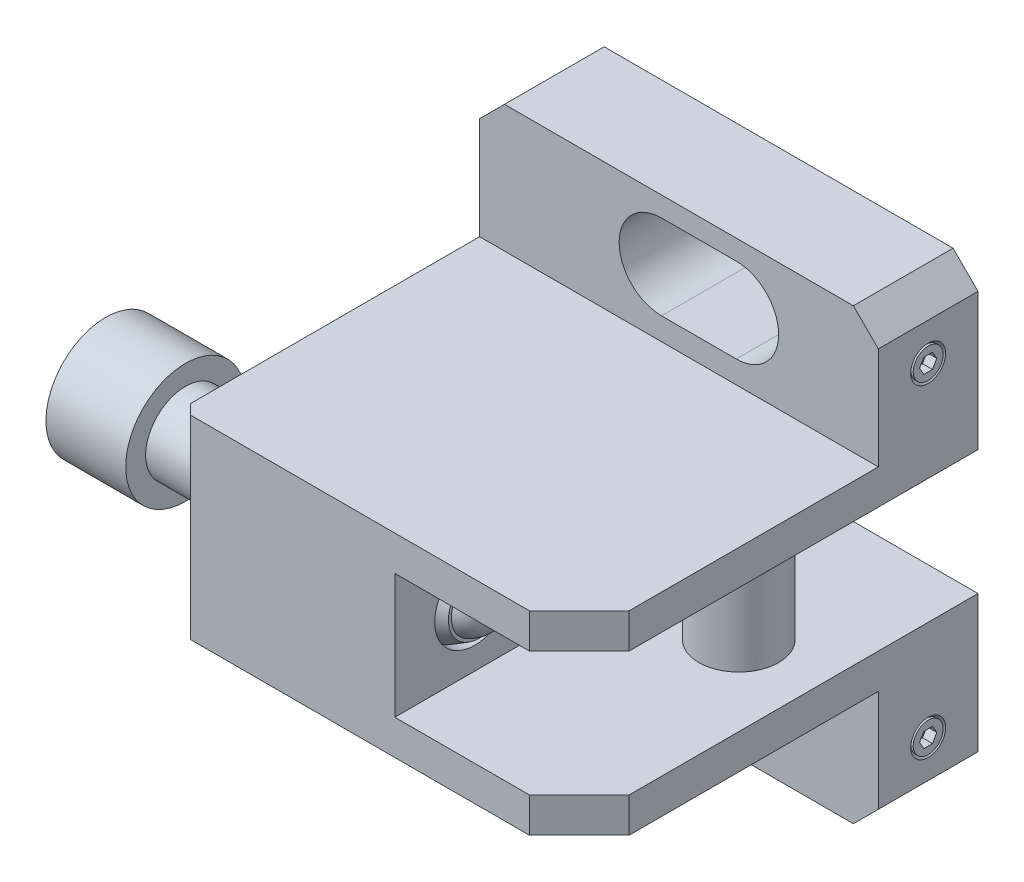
ISO-10303-21;
HEADER;
FILE_DESCRIPTION(('STEP AP214'),'2;1');
FILE_NAME('part.step','',(''),(''),'','','');
FILE_SCHEMA(('AUTOMOTIVE_DESIGN { 1 0 10303 214 1 1 1 1 }'));
ENDSEC;
DATA;
#1=APPLICATION_CONTEXT('core data for automotive mechanical design processes');
#2=APPLICATION_PROTOCOL_DEFINITION('international standard','automotive_design',2000,#1);
#3=PRODUCT_CONTEXT('',#1,'mechanical');
#4=PRODUCT('Part','Part','',(#3));
#5=PRODUCT_RELATED_PRODUCT_CATEGORY('part','',(#4));
#6=PRODUCT_DEFINITION_FORMATION('','',#4);
#7=PRODUCT_DEFINITION_CONTEXT('part definition',#1,'design');
#8=PRODUCT_DEFINITION('design','',#6,#7);
#9=PRODUCT_DEFINITION_SHAPE('','',#8);
#10=(LENGTH_UNIT() NAMED_UNIT(*) SI_UNIT(.MILLI.,.METRE.));
#11=(NAMED_UNIT(*) PLANE_ANGLE_UNIT() SI_UNIT($,.RADIAN.));
#12=(NAMED_UNIT(*) SI_UNIT($,.STERADIAN.) SOLID_ANGLE_UNIT());
#13=UNCERTAINTY_MEASURE_WITH_UNIT(LENGTH_MEASURE(1.E-05),#10,'distance_accuracy_value','');
#14=(GEOMETRIC_REPRESENTATION_CONTEXT(3) GLOBAL_UNCERTAINTY_ASSIGNED_CONTEXT((#13)) GLOBAL_UNIT_ASSIGNED_CONTEXT((#10,
#11,#12)) REPRESENTATION_CONTEXT('',''));
#15=CARTESIAN_POINT('',(0.,0.,0.));
#16=DIRECTION('',(0.,0.,1.));
#17=DIRECTION('',(1.,0.,0.));
#18=AXIS2_PLACEMENT_3D('',#15,#16,#17);
#19=CARTESIAN_POINT('',(-74.5,20.982989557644,56.0401965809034));
#20=DIRECTION('',(-1.,0.,0.));
#21=DIRECTION('',(0.,0.822643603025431,0.568557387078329));
#22=AXIS2_PLACEMENT_3D('',#19,#20,#21);
#23=PLANE('',#22);
#24=DIRECTION('',(0.,0.428151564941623,0.903706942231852));
#25=VECTOR('',#24,1.);
#26=CARTESIAN_POINT('',(-74.5,24.443697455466,63.3447728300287));
#27=LINE('',#26,#25);
#28=CARTESIAN_POINT('',(-74.5,24.443697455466,63.3447728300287));
#29=VERTEX_POINT('',#28);
#30=CARTESIAN_POINT('',(-74.5,27.9044053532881,70.649349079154));
#31=VERTEX_POINT('',#30);
#32=EDGE_CURVE('E705',#29,#31,#27,.T.);
#33=ORIENTED_EDGE('',*,*,#32,.T.);
#34=DIRECTION('',(0.,-0.996708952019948,-0.081063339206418));
#35=VECTOR('',#34,1.);
#36=CARTESIAN_POINT('',(-74.5,35.9607078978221,71.3045762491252));
#37=LINE('',#36,#35);
#38=CARTESIAN_POINT('',(-74.5,35.9607078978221,71.3045762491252));
#39=VERTEX_POINT('',#38);
#40=EDGE_CURVE('E707',#39,#31,#37,.T.);
#41=ORIENTED_EDGE('',*,*,#40,.F.);
#42=DIRECTION('',(0.,-0.568557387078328,0.822643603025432));
#43=VECTOR('',#42,1.);
#44=CARTESIAN_POINT('',(-74.5,40.556302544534,64.6552271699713));
#45=LINE('',#44,#43);
#46=CARTESIAN_POINT('',(-74.5,40.556302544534,64.6552271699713));
#47=VERTEX_POINT('',#46);
#48=EDGE_CURVE('E710',#47,#39,#45,.T.);
#49=ORIENTED_EDGE('',*,*,#48,.F.);
#50=DIRECTION('',(0.,-0.428151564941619,-0.90370694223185));
#51=VECTOR('',#50,1.);
#52=CARTESIAN_POINT('',(-74.5,40.556302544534,64.6552271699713));
#53=LINE('',#52,#51);
#54=CARTESIAN_POINT('',(-74.5,37.0955946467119,57.3506509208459));
#55=VERTEX_POINT('',#54);
#56=EDGE_CURVE('E335',#47,#55,#53,.T.);
#57=ORIENTED_EDGE('',*,*,#56,.T.);
#58=DIRECTION('',(0.,0.996708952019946,0.081063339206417));
#59=VECTOR('',#58,1.);
#60=CARTESIAN_POINT('',(-74.5,29.0392921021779,56.6954237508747));
#61=LINE('',#60,#59);
#62=CARTESIAN_POINT('',(-74.5,29.0392921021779,56.6954237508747));
#63=VERTEX_POINT('',#62);
#64=EDGE_CURVE('E318',#63,#55,#61,.T.);
#65=ORIENTED_EDGE('',*,*,#64,.F.);
#66=DIRECTION('',(0.,-0.568557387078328,0.822643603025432));
#67=VECTOR('',#66,1.);
#68=CARTESIAN_POINT('',(-74.5,29.0392921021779,56.6954237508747));
#69=LINE('',#68,#67);
#70=EDGE_CURVE('E332',#63,#29,#69,.T.);
#71=ORIENTED_EDGE('',*,*,#70,.T.);
#72=EDGE_LOOP('',(#33,#41,#49,#57,#65,#71));
#73=FACE_BOUND('',#72,.T.);
#74=ADVANCED_FACE('F14',(#73),#23,.T.);
#75=CARTESIAN_POINT('',(-74.5,35.9607078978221,71.3045762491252));
#76=DIRECTION('',(0.,0.0810633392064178,-0.996708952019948));
#77=DIRECTION('',(0.,0.996708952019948,0.081063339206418));
#78=AXIS2_PLACEMENT_3D('',#75,#76,#77);
#79=PLANE('',#78);
#80=ORIENTED_EDGE('',*,*,#40,.T.);
#81=DIRECTION('',(-1.,0.,0.));
#82=VECTOR('',#81,1.);
#83=CARTESIAN_POINT('',(-74.5,27.9044053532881,70.649349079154));
#84=LINE('',#83,#82);
#85=CARTESIAN_POINT('',(-82.5,27.9044053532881,70.649349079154));
#86=VERTEX_POINT('',#85);
#87=EDGE_CURVE('E339',#31,#86,#84,.T.);
#88=ORIENTED_EDGE('',*,*,#87,.T.);
#89=DIRECTION('',(0.,-0.996708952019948,-0.081063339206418));
#90=VECTOR('',#89,1.);
#91=CARTESIAN_POINT('',(-82.5,35.9607078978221,71.3045762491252));
#92=LINE('',#91,#90);
#93=CARTESIAN_POINT('',(-82.5,35.9607078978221,71.3045762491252));
#94=VERTEX_POINT('',#93);
#95=EDGE_CURVE('E691',#94,#86,#92,.T.);
#96=ORIENTED_EDGE('',*,*,#95,.F.);
#97=DIRECTION('',(-1.,0.,0.));
#98=VECTOR('',#97,1.);
#99=CARTESIAN_POINT('',(-74.5,35.9607078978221,71.3045762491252));
#100=LINE('',#99,#98);
#101=EDGE_CURVE('E289',#39,#94,#100,.T.);
#102=ORIENTED_EDGE('',*,*,#101,.F.);
#103=EDGE_LOOP('',(#80,#88,#96,#102));
#104=FACE_BOUND('',#103,.T.);
#105=ADVANCED_FACE('F720',(#104),#79,.T.);
#106=CARTESIAN_POINT('',(-74.5,40.556302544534,64.6552271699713));
#107=DIRECTION('',(0.,-0.822643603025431,-0.568557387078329));
#108=DIRECTION('',(0.,0.568557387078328,-0.822643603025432));
#109=AXIS2_PLACEMENT_3D('',#106,#107,#108);
#110=PLANE('',#109);
#111=ORIENTED_EDGE('',*,*,#101,.T.);
#112=DIRECTION('',(0.,-0.568557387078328,0.822643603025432));
#113=VECTOR('',#112,1.);
#114=CARTESIAN_POINT('',(-82.5,40.556302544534,64.6552271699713));
#115=LINE('',#114,#113);
#116=CARTESIAN_POINT('',(-82.5,40.556302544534,64.6552271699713));
#117=VERTEX_POINT('',#116);
#118=EDGE_CURVE('E694',#117,#94,#115,.T.);
#119=ORIENTED_EDGE('',*,*,#118,.F.);
#120=DIRECTION('',(-1.,0.,0.));
#121=VECTOR('',#120,1.);
#122=CARTESIAN_POINT('',(-74.5,40.556302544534,64.6552271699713));
#123=LINE('',#122,#121);
#124=EDGE_CURVE('E345',#47,#117,#123,.T.);
#125=ORIENTED_EDGE('',*,*,#124,.F.);
#126=ORIENTED_EDGE('',*,*,#48,.T.);
#127=EDGE_LOOP('',(#111,#119,#125,#126));
#128=FACE_BOUND('',#127,.T.);
#129=ADVANCED_FACE('F711',(#128),#110,.T.);
#130=CARTESIAN_POINT('',(-74.5,40.556302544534,64.6552271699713));
#131=DIRECTION('',(0.,0.903706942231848,-0.428151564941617));
#132=DIRECTION('',(0.,0.428151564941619,0.90370694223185));
#133=AXIS2_PLACEMENT_3D('',#130,#131,#132);
#134=PLANE('',#133);
#135=ORIENTED_EDGE('',*,*,#124,.T.);
#136=DIRECTION('',(0.,-0.428151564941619,-0.90370694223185));
#137=VECTOR('',#136,1.);
#138=CARTESIAN_POINT('',(-82.5,40.556302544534,64.6552271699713));
#139=LINE('',#138,#137);
#140=CARTESIAN_POINT('',(-82.5,37.0955946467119,57.3506509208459));
#141=VERTEX_POINT('',#140);
#142=EDGE_CURVE('E699',#117,#141,#139,.T.);
#143=ORIENTED_EDGE('',*,*,#142,.T.);
#144=DIRECTION('',(-1.,0.,0.));
#145=VECTOR('',#144,1.);
#146=CARTESIAN_POINT('',(-74.5,37.0955946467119,57.3506509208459));
#147=LINE('',#146,#145);
#148=EDGE_CURVE('E326',#55,#141,#147,.T.);
#149=ORIENTED_EDGE('',*,*,#148,.F.);
#150=ORIENTED_EDGE('',*,*,#56,.F.);
#151=EDGE_LOOP('',(#135,#143,#149,#150));
#152=FACE_BOUND('',#151,.T.);
#153=ADVANCED_FACE('F714',(#152),#134,.F.);
#154=CARTESIAN_POINT('',(-74.5,29.0392921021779,56.6954237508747));
#155=DIRECTION('',(0.,-0.0810633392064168,0.996708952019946));
#156=DIRECTION('',(0.,-0.996708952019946,-0.081063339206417));
#157=AXIS2_PLACEMENT_3D('',#154,#155,#156);
#158=PLANE('',#157);
#159=ORIENTED_EDGE('',*,*,#148,.T.);
#160=DIRECTION('',(0.,0.996708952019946,0.081063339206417));
#161=VECTOR('',#160,1.);
#162=CARTESIAN_POINT('',(-82.5,29.0392921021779,56.6954237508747));
#163=LINE('',#162,#161);
#164=CARTESIAN_POINT('',(-82.5,29.0392921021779,56.6954237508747));
#165=VERTEX_POINT('',#164);
#166=EDGE_CURVE('E320',#165,#141,#163,.T.);
#167=ORIENTED_EDGE('',*,*,#166,.F.);
#168=DIRECTION('',(-1.,0.,0.));
#169=VECTOR('',#168,1.);
#170=CARTESIAN_POINT('',(-74.5,29.0392921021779,56.6954237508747));
#171=LINE('',#170,#169);
#172=EDGE_CURVE('E315',#63,#165,#171,.T.);
#173=ORIENTED_EDGE('',*,*,#172,.F.);
#174=ORIENTED_EDGE('',*,*,#64,.T.);
#175=EDGE_LOOP('',(#159,#167,#173,#174));
#176=FACE_BOUND('',#175,.T.);
#177=ADVANCED_FACE('F317',(#176),#158,.T.);
#178=CARTESIAN_POINT('',(-74.5,29.0392921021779,56.6954237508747));
#179=DIRECTION('',(0.,-0.822643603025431,-0.568557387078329));
#180=DIRECTION('',(0.,0.568557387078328,-0.822643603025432));
#181=AXIS2_PLACEMENT_3D('',#178,#179,#180);
#182=PLANE('',#181);
#183=ORIENTED_EDGE('',*,*,#172,.T.);
#184=DIRECTION('',(0.,-0.568557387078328,0.822643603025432));
#185=VECTOR('',#184,1.);
#186=CARTESIAN_POINT('',(-82.5,29.0392921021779,56.6954237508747));
#187=LINE('',#186,#185);
#188=CARTESIAN_POINT('',(-82.5,24.443697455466,63.3447728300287));
#189=VERTEX_POINT('',#188);
#190=EDGE_CURVE('E703',#165,#189,#187,.T.);
#191=ORIENTED_EDGE('',*,*,#190,.T.);
#192=DIRECTION('',(-1.,0.,0.));
#193=VECTOR('',#192,1.);
#194=CARTESIAN_POINT('',(-74.5,24.443697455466,63.3447728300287));
#195=LINE('',#194,#193);
#196=EDGE_CURVE('E325',#29,#189,#195,.T.);
#197=ORIENTED_EDGE('',*,*,#196,.F.);
#198=ORIENTED_EDGE('',*,*,#70,.F.);
#199=EDGE_LOOP('',(#183,#191,#197,#198));
#200=FACE_BOUND('',#199,.T.);
#201=ADVANCED_FACE('F337',(#200),#182,.F.);
#202=CARTESIAN_POINT('',(-74.5,24.443697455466,63.3447728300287));
#203=DIRECTION('',(0.,-0.903706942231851,0.428151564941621));
#204=DIRECTION('',(0.,-0.428151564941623,-0.903706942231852));
#205=AXIS2_PLACEMENT_3D('',#202,#203,#204);
#206=PLANE('',#205);
#207=ORIENTED_EDGE('',*,*,#196,.T.);
#208=DIRECTION('',(0.,0.428151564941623,0.903706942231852));
#209=VECTOR('',#208,1.);
#210=CARTESIAN_POINT('',(-82.5,24.443697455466,63.3447728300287));
#211=LINE('',#210,#209);
#212=EDGE_CURVE('E33',#189,#86,#211,.T.);
#213=ORIENTED_EDGE('',*,*,#212,.T.);
#214=ORIENTED_EDGE('',*,*,#87,.F.);
#215=ORIENTED_EDGE('',*,*,#32,.F.);
#216=EDGE_LOOP('',(#207,#213,#214,#215));
#217=FACE_BOUND('',#216,.T.);
#218=ADVANCED_FACE('F721',(#217),#206,.F.);
#219=CARTESIAN_POINT('',(-82.5,22.6282767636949,57.17731135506));
#220=DIRECTION('',(-1.,0.,0.));
#221=DIRECTION('',(0.,0.822643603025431,0.568557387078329));
#222=AXIS2_PLACEMENT_3D('',#219,#220,#221);
#223=PLANE('',#222);
#224=ORIENTED_EDGE('',*,*,#212,.F.);
#225=ORIENTED_EDGE('',*,*,#190,.F.);
#226=ORIENTED_EDGE('',*,*,#166,.T.);
#227=ORIENTED_EDGE('',*,*,#142,.F.);
#228=ORIENTED_EDGE('',*,*,#118,.T.);
#229=ORIENTED_EDGE('',*,*,#95,.T.);
#230=EDGE_LOOP('',(#224,#225,#226,#227,#228,#229));
#231=FACE_BOUND('',#230,.T.);
#232=CARTESIAN_POINT('',(-82.5,32.5,64.));
#233=DIRECTION('',(1.,0.,0.));
#234=DIRECTION('',(0.,-0.822643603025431,-0.568557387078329));
#235=AXIS2_PLACEMENT_3D('',#232,#233,#234);
#236=CIRCLE('',#235,12.);
#237=CARTESIAN_POINT('',(-82.5,22.6282767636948,57.1773113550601));
#238=VERTEX_POINT('',#237);
#239=EDGE_CURVE('E349',#238,#238,#236,.T.);
#240=ORIENTED_EDGE('',*,*,#239,.F.);
#241=EDGE_LOOP('',(#240));
#242=FACE_BOUND('',#241,.T.);
#243=ADVANCED_FACE('F717',(#231,#242),#223,.T.);
#244=CARTESIAN_POINT('',(23.5,32.5,64.));
#245=DIRECTION('',(1.,0.,0.));
#246=DIRECTION('',(0.,-0.822643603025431,-0.568557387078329));
#247=AXIS2_PLACEMENT_3D('',#244,#245,#246);
#248=CYLINDRICAL_SURFACE('',#247,12.);
#249=ORIENTED_EDGE('',*,*,#239,.T.);
#250=EDGE_LOOP('',(#249));
#251=FACE_BOUND('',#250,.T.);
#252=CARTESIAN_POINT('',(-66.5,32.5,64.));
#253=DIRECTION('',(1.,0.,0.));
#254=DIRECTION('',(0.,-0.822643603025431,-0.568557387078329));
#255=AXIS2_PLACEMENT_3D('',#252,#253,#254);
#256=CIRCLE('',#255,12.);
#257=CARTESIAN_POINT('',(-66.5,22.6282767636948,57.1773113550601));
#258=VERTEX_POINT('',#257);
#259=EDGE_CURVE('E352',#258,#258,#256,.T.);
#260=ORIENTED_EDGE('',*,*,#259,.F.);
#261=EDGE_LOOP('',(#260));
#262=FACE_BOUND('',#261,.T.);
#263=ADVANCED_FACE('F730',(#251,#262),#248,.T.);
#264=CARTESIAN_POINT('',(-66.5,25.9188511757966,59.4515409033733));
#265=DIRECTION('',(1.,0.,0.));
#266=DIRECTION('',(0.,-0.822643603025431,-0.568557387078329));
#267=AXIS2_PLACEMENT_3D('',#264,#265,#266);
#268=PLANE('',#267);
#269=ORIENTED_EDGE('',*,*,#259,.T.);
#270=EDGE_LOOP('',(#269));
#271=FACE_BOUND('',#270,.T.);
#272=CARTESIAN_POINT('',(-66.5,32.5,64.));
#273=DIRECTION('',(1.,0.,0.));
#274=DIRECTION('',(0.,-0.822643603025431,-0.568557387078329));
#275=AXIS2_PLACEMENT_3D('',#272,#273,#274);
#276=CIRCLE('',#275,8.);
#277=CARTESIAN_POINT('',(-66.5,25.9188511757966,59.4515409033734));
#278=VERTEX_POINT('',#277);
#279=EDGE_CURVE('E355',#278,#278,#276,.T.);
#280=ORIENTED_EDGE('',*,*,#279,.F.);
#281=EDGE_LOOP('',(#280));
#282=FACE_BOUND('',#281,.T.);
#283=ADVANCED_FACE('F1376',(#271,#282),#268,.T.);
#284=CARTESIAN_POINT('',(23.5,32.5,64.));
#285=DIRECTION('',(1.,0.,0.));
#286=DIRECTION('',(0.,-0.822643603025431,-0.568557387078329));
#287=AXIS2_PLACEMENT_3D('',#284,#285,#286);
#288=CYLINDRICAL_SURFACE('',#287,8.);
#289=CARTESIAN_POINT('',(-51.5,32.5,64.));
#290=DIRECTION('',(-1.,0.,0.));
#291=DIRECTION('',(0.,0.,1.));
#292=AXIS2_PLACEMENT_3D('',#289,#290,#291);
#293=CIRCLE('',#292,8.);
#294=CARTESIAN_POINT('',(-51.5,32.5,72.));
#295=VERTEX_POINT('',#294);
#296=EDGE_CURVE('E9',#295,#295,#293,.F.);
#297=ORIENTED_EDGE('',*,*,#296,.F.);
#298=EDGE_LOOP('',(#297));
#299=FACE_BOUND('',#298,.T.);
#300=ORIENTED_EDGE('',*,*,#279,.T.);
#301=EDGE_LOOP('',(#300));
#302=FACE_BOUND('',#301,.T.);
#303=ADVANCED_FACE('F1366',(#299,#302),#288,.T.);
#304=CARTESIAN_POINT('',(-9.5,32.5,64.));
#305=DIRECTION('',(1.,0.,0.));
#306=DIRECTION('',(0.,-0.822643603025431,-0.568557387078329));
#307=AXIS2_PLACEMENT_3D('',#304,#305,#306);
#308=SPHERICAL_SURFACE('',#307,6.);
#309=CARTESIAN_POINT('',(-7.5,32.5,64.));
#310=DIRECTION('',(1.,0.,0.));
#311=DIRECTION('',(0.,-0.822643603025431,-0.568557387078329));
#312=AXIS2_PLACEMENT_3D('',#309,#310,#311);
#313=CIRCLE('',#312,5.65685424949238);
#314=CARTESIAN_POINT('',(-7.5,27.8464250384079,60.7837537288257));
#315=VERTEX_POINT('',#314);
#316=EDGE_CURVE('E24',#315,#315,#313,.T.);
#317=ORIENTED_EDGE('',*,*,#316,.T.);
#318=EDGE_LOOP('',(#317));
#319=FACE_BOUND('',#318,.T.);
#320=ADVANCED_FACE('F1356',(#319),#308,.T.);
#321=CARTESIAN_POINT('',(-7.5,27.3584774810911,60.4465163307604));
#322=DIRECTION('',(-1.,0.,0.));
#323=DIRECTION('',(0.,0.822643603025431,0.568557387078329));
#324=AXIS2_PLACEMENT_3D('',#321,#322,#323);
#325=PLANE('',#324);
#326=ORIENTED_EDGE('',*,*,#316,.F.);
#327=EDGE_LOOP('',(#326));
#328=FACE_BOUND('',#327,.T.);
#329=CARTESIAN_POINT('',(-7.5,32.5,64.));
#330=DIRECTION('',(1.,0.,0.));
#331=DIRECTION('',(0.,-0.822643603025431,-0.568557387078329));
#332=AXIS2_PLACEMENT_3D('',#329,#330,#331);
#333=CIRCLE('',#332,6.25);
#334=CARTESIAN_POINT('',(-7.5,27.3584774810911,60.4465163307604));
#335=VERTEX_POINT('',#334);
#336=EDGE_CURVE('E361',#335,#335,#333,.T.);
#337=ORIENTED_EDGE('',*,*,#336,.T.);
#338=EDGE_LOOP('',(#337));
#339=FACE_BOUND('',#338,.T.);
#340=ADVANCED_FACE('F1346',(#328,#339),#325,.F.);
#341=CARTESIAN_POINT('',(-7.5,32.5,64.));
#342=DIRECTION('',(-1.,0.,0.));
#343=DIRECTION('',(0.,0.822643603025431,0.568557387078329));
#344=AXIS2_PLACEMENT_3D('',#341,#342,#343);
#345=CONICAL_SURFACE('',#344,6.25,0.523598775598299);
#346=CARTESIAN_POINT('',(-10.5310889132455,32.5,64.));
#347=DIRECTION('',(1.,0.,0.));
#348=DIRECTION('',(0.,-0.822643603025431,-0.568557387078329));
#349=AXIS2_PLACEMENT_3D('',#346,#347,#348);
#350=CIRCLE('',#349,8.);
#351=CARTESIAN_POINT('',(-10.5310889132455,25.9188511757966,59.4515409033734));
#352=VERTEX_POINT('',#351);
#353=EDGE_CURVE('E358',#352,#352,#350,.T.);
#354=ORIENTED_EDGE('',*,*,#353,.T.);
#355=EDGE_LOOP('',(#354));
#356=FACE_BOUND('',#355,.T.);
#357=ORIENTED_EDGE('',*,*,#336,.F.);
#358=EDGE_LOOP('',(#357));
#359=FACE_BOUND('',#358,.T.);
#360=ADVANCED_FACE('F1336',(#356,#359),#345,.T.);
#361=CARTESIAN_POINT('',(26.5,3.,10.));
#362=DIRECTION('',(1.,0.,0.));
#363=DIRECTION('',(0.,1.,0.));
#364=AXIS2_PLACEMENT_3D('',#361,#362,#363);
#365=PLANE('',#364);
#366=DIRECTION('',(0.,0.866025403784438,-0.5));
#367=VECTOR('',#366,1.);
#368=CARTESIAN_POINT('',(26.5,0.,11.7320508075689));
#369=LINE('',#368,#367);
#370=CARTESIAN_POINT('',(26.5,0.,11.7320508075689));
#371=VERTEX_POINT('',#370);
#372=CARTESIAN_POINT('',(26.5,1.5,10.8660254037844));
#373=VERTEX_POINT('',#372);
#374=EDGE_CURVE('E369',#371,#373,#369,.T.);
#375=ORIENTED_EDGE('',*,*,#374,.F.);
#376=DIRECTION('',(0.,-0.866025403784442,-0.499999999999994));
#377=VECTOR('',#376,1.);
#378=CARTESIAN_POINT('',(26.5,0.,11.7320508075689));
#379=LINE('',#378,#377);
#380=CARTESIAN_POINT('',(26.5,-1.5,10.8660254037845));
#381=VERTEX_POINT('',#380);
#382=EDGE_CURVE('E385',#371,#381,#379,.T.);
#383=ORIENTED_EDGE('',*,*,#382,.T.);
#384=DIRECTION('',(0.,0.,-1.));
#385=VECTOR('',#384,1.);
#386=CARTESIAN_POINT('',(26.5,-1.5,10.8660254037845));
#387=LINE('',#386,#385);
#388=CARTESIAN_POINT('',(26.5,-1.5,9.13397459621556));
#389=VERTEX_POINT('',#388);
#390=EDGE_CURVE('E389',#381,#389,#387,.T.);
#391=ORIENTED_EDGE('',*,*,#390,.T.);
#392=DIRECTION('',(0.,-0.866025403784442,0.5));
#393=VECTOR('',#392,1.);
#394=CARTESIAN_POINT('',(26.5,0.,8.26794919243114));
#395=LINE('',#394,#393);
#396=CARTESIAN_POINT('',(26.5,0.,8.26794919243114));
#397=VERTEX_POINT('',#396);
#398=EDGE_CURVE('E392',#397,#389,#395,.T.);
#399=ORIENTED_EDGE('',*,*,#398,.F.);
#400=DIRECTION('',(0.,0.866025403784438,0.5));
#401=VECTOR('',#400,1.);
#402=CARTESIAN_POINT('',(26.5,0.,8.26794919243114));
#403=LINE('',#402,#401);
#404=CARTESIAN_POINT('',(26.5,1.5,9.13397459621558));
#405=VERTEX_POINT('',#404);
#406=EDGE_CURVE('E395',#397,#405,#403,.T.);
#407=ORIENTED_EDGE('',*,*,#406,.T.);
#408=DIRECTION('',(0.,0.,-1.));
#409=VECTOR('',#408,1.);
#410=CARTESIAN_POINT('',(26.5,1.5,10.8660254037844));
#411=LINE('',#410,#409);
#412=EDGE_CURVE('E398',#373,#405,#411,.T.);
#413=ORIENTED_EDGE('',*,*,#412,.F.);
#414=EDGE_LOOP('',(#375,#383,#391,#399,#407,#413));
#415=FACE_BOUND('',#414,.T.);
#416=ADVANCED_FACE('F1310',(#415),#365,.T.);
#417=CARTESIAN_POINT('',(26.5,68.,10.));
#418=DIRECTION('',(1.,0.,0.));
#419=DIRECTION('',(0.,1.,0.));
#420=AXIS2_PLACEMENT_3D('',#417,#418,#419);
#421=PLANE('',#420);
#422=DIRECTION('',(0.,0.866025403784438,-0.5));
#423=VECTOR('',#422,1.);
#424=CARTESIAN_POINT('',(26.5,65.,11.7320508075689));
#425=LINE('',#424,#423);
#426=CARTESIAN_POINT('',(26.5,65.,11.7320508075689));
#427=VERTEX_POINT('',#426);
#428=CARTESIAN_POINT('',(26.5,66.5,10.8660254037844));
#429=VERTEX_POINT('',#428);
#430=EDGE_CURVE('E422',#427,#429,#425,.T.);
#431=ORIENTED_EDGE('',*,*,#430,.F.);
#432=DIRECTION('',(0.,-0.866025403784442,-0.499999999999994));
#433=VECTOR('',#432,1.);
#434=CARTESIAN_POINT('',(26.5,65.,11.7320508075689));
#435=LINE('',#434,#433);
#436=CARTESIAN_POINT('',(26.5,63.5,10.8660254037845));
#437=VERTEX_POINT('',#436);
#438=EDGE_CURVE('E437',#427,#437,#435,.T.);
#439=ORIENTED_EDGE('',*,*,#438,.T.);
#440=DIRECTION('',(0.,0.,-1.));
#441=VECTOR('',#440,1.);
#442=CARTESIAN_POINT('',(26.5,63.5,10.8660254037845));
#443=LINE('',#442,#441);
#444=CARTESIAN_POINT('',(26.5,63.5,9.13397459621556));
#445=VERTEX_POINT('',#444);
#446=EDGE_CURVE('E441',#437,#445,#443,.T.);
#447=ORIENTED_EDGE('',*,*,#446,.T.);
#448=DIRECTION('',(0.,-0.866025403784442,0.5));
#449=VECTOR('',#448,1.);
#450=CARTESIAN_POINT('',(26.5,65.,8.26794919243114));
#451=LINE('',#450,#449);
#452=CARTESIAN_POINT('',(26.5,65.,8.26794919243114));
#453=VERTEX_POINT('',#452);
#454=EDGE_CURVE('E444',#453,#445,#451,.T.);
#455=ORIENTED_EDGE('',*,*,#454,.F.);
#456=DIRECTION('',(0.,0.866025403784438,0.5));
#457=VECTOR('',#456,1.);
#458=CARTESIAN_POINT('',(26.5,65.,8.26794919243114));
#459=LINE('',#458,#457);
#460=CARTESIAN_POINT('',(26.5,66.5,9.13397459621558));
#461=VERTEX_POINT('',#460);
#462=EDGE_CURVE('E447',#453,#461,#459,.T.);
#463=ORIENTED_EDGE('',*,*,#462,.T.);
#464=DIRECTION('',(0.,0.,-1.));
#465=VECTOR('',#464,1.);
#466=CARTESIAN_POINT('',(26.5,66.5,10.8660254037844));
#467=LINE('',#466,#465);
#468=EDGE_CURVE('E450',#429,#461,#467,.T.);
#469=ORIENTED_EDGE('',*,*,#468,.F.);
#470=EDGE_LOOP('',(#431,#439,#447,#455,#463,#469));
#471=FACE_BOUND('',#470,.T.);
#472=ADVANCED_FACE('F1251',(#471),#421,.T.);
#473=CARTESIAN_POINT('',(26.5,0.,11.7320508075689));
#474=DIRECTION('',(0.,-0.499999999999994,0.866025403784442));
#475=DIRECTION('',(0.,-0.866025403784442,-0.499999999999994));
#476=AXIS2_PLACEMENT_3D('',#473,#474,#475);
#477=PLANE('',#476);
#478=ORIENTED_EDGE('',*,*,#382,.F.);
#479=DIRECTION('',(1.,0.,0.));
#480=VECTOR('',#479,1.);
#481=CARTESIAN_POINT('',(26.5,0.,11.7320508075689));
#482=LINE('',#481,#480);
#483=CARTESIAN_POINT('',(28.5,0.,11.7320508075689));
#484=VERTEX_POINT('',#483);
#485=EDGE_CURVE('E388',#371,#484,#482,.T.);
#486=ORIENTED_EDGE('',*,*,#485,.T.);
#487=DIRECTION('',(0.,-0.866025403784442,-0.499999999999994));
#488=VECTOR('',#487,1.);
#489=CARTESIAN_POINT('',(28.5,0.,11.7320508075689));
#490=LINE('',#489,#488);
#491=CARTESIAN_POINT('',(28.5,-1.5,10.8660254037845));
#492=VERTEX_POINT('',#491);
#493=EDGE_CURVE('E366',#484,#492,#490,.T.);
#494=ORIENTED_EDGE('',*,*,#493,.T.);
#495=DIRECTION('',(1.,0.,0.));
#496=VECTOR('',#495,1.);
#497=CARTESIAN_POINT('',(26.5,-1.5,10.8660254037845));
#498=LINE('',#497,#496);
#499=EDGE_CURVE('E405',#381,#492,#498,.T.);
#500=ORIENTED_EDGE('',*,*,#499,.F.);
#501=EDGE_LOOP('',(#478,#486,#494,#500));
#502=FACE_BOUND('',#501,.T.);
#503=ADVANCED_FACE('F1201',(#502),#477,.F.);
#504=CARTESIAN_POINT('',(26.5,-1.5,10.8660254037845));
#505=DIRECTION('',(0.,-1.,0.));
#506=DIRECTION('',(1.,0.,0.));
#507=AXIS2_PLACEMENT_3D('',#504,#505,#506);
#508=PLANE('',#507);
#509=ORIENTED_EDGE('',*,*,#499,.T.);
#510=DIRECTION('',(0.,0.,-1.));
#511=VECTOR('',#510,1.);
#512=CARTESIAN_POINT('',(28.5,-1.5,10.8660254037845));
#513=LINE('',#512,#511);
#514=CARTESIAN_POINT('',(28.5,-1.5,9.13397459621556));
#515=VERTEX_POINT('',#514);
#516=EDGE_CURVE('E370',#492,#515,#513,.T.);
#517=ORIENTED_EDGE('',*,*,#516,.T.);
#518=DIRECTION('',(1.,0.,0.));
#519=VECTOR('',#518,1.);
#520=CARTESIAN_POINT('',(26.5,-1.5,9.13397459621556));
#521=LINE('',#520,#519);
#522=EDGE_CURVE('E407',#389,#515,#521,.T.);
#523=ORIENTED_EDGE('',*,*,#522,.F.);
#524=ORIENTED_EDGE('',*,*,#390,.F.);
#525=EDGE_LOOP('',(#509,#517,#523,#524));
#526=FACE_BOUND('',#525,.T.);
#527=ADVANCED_FACE('F1298',(#526),#508,.F.);
#528=CARTESIAN_POINT('',(26.5,0.,8.26794919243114));
#529=DIRECTION('',(0.,0.5,0.866025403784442));
#530=DIRECTION('',(0.,-0.866025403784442,0.5));
#531=AXIS2_PLACEMENT_3D('',#528,#529,#530);
#532=PLANE('',#531);
#533=ORIENTED_EDGE('',*,*,#522,.T.);
#534=DIRECTION('',(0.,-0.866025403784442,0.5));
#535=VECTOR('',#534,1.);
#536=CARTESIAN_POINT('',(28.5,0.,8.26794919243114));
#537=LINE('',#536,#535);
#538=CARTESIAN_POINT('',(28.5,0.,8.26794919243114));
#539=VERTEX_POINT('',#538);
#540=EDGE_CURVE('E373',#539,#515,#537,.T.);
#541=ORIENTED_EDGE('',*,*,#540,.F.);
#542=DIRECTION('',(1.,0.,0.));
#543=VECTOR('',#542,1.);
#544=CARTESIAN_POINT('',(26.5,0.,8.26794919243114));
#545=LINE('',#544,#543);
#546=EDGE_CURVE('E409',#397,#539,#545,.T.);
#547=ORIENTED_EDGE('',*,*,#546,.F.);
#548=ORIENTED_EDGE('',*,*,#398,.T.);
#549=EDGE_LOOP('',(#533,#541,#547,#548));
#550=FACE_BOUND('',#549,.T.);
#551=ADVANCED_FACE('F1288',(#550),#532,.T.);
#552=CARTESIAN_POINT('',(26.5,0.,8.26794919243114));
#553=DIRECTION('',(0.,0.5,-0.866025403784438));
#554=DIRECTION('',(0.,0.866025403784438,0.5));
#555=AXIS2_PLACEMENT_3D('',#552,#553,#554);
#556=PLANE('',#555);
#557=ORIENTED_EDGE('',*,*,#546,.T.);
#558=DIRECTION('',(0.,0.866025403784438,0.5));
#559=VECTOR('',#558,1.);
#560=CARTESIAN_POINT('',(28.5,0.,8.26794919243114));
#561=LINE('',#560,#559);
#562=CARTESIAN_POINT('',(28.5,1.5,9.13397459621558));
#563=VERTEX_POINT('',#562);
#564=EDGE_CURVE('E376',#539,#563,#561,.T.);
#565=ORIENTED_EDGE('',*,*,#564,.T.);
#566=DIRECTION('',(1.,0.,0.));
#567=VECTOR('',#566,1.);
#568=CARTESIAN_POINT('',(26.5,1.5,9.13397459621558));
#569=LINE('',#568,#567);
#570=EDGE_CURVE('E411',#405,#563,#569,.T.);
#571=ORIENTED_EDGE('',*,*,#570,.F.);
#572=ORIENTED_EDGE('',*,*,#406,.F.);
#573=EDGE_LOOP('',(#557,#565,#571,#572));
#574=FACE_BOUND('',#573,.T.);
#575=ADVANCED_FACE('F1278',(#574),#556,.F.);
#576=CARTESIAN_POINT('',(26.5,1.5,10.8660254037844));
#577=DIRECTION('',(0.,-1.,0.));
#578=DIRECTION('',(1.,0.,0.));
#579=AXIS2_PLACEMENT_3D('',#576,#577,#578);
#580=PLANE('',#579);
#581=ORIENTED_EDGE('',*,*,#570,.T.);
#582=DIRECTION('',(0.,0.,-1.));
#583=VECTOR('',#582,1.);
#584=CARTESIAN_POINT('',(28.5,1.5,10.8660254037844));
#585=LINE('',#584,#583);
#586=CARTESIAN_POINT('',(28.5,1.5,10.8660254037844));
#587=VERTEX_POINT('',#586);
#588=EDGE_CURVE('E379',#587,#563,#585,.T.);
#589=ORIENTED_EDGE('',*,*,#588,.F.);
#590=DIRECTION('',(1.,0.,0.));
#591=VECTOR('',#590,1.);
#592=CARTESIAN_POINT('',(26.5,1.5,10.8660254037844));
#593=LINE('',#592,#591);
#594=EDGE_CURVE('E413',#373,#587,#593,.T.);
#595=ORIENTED_EDGE('',*,*,#594,.F.);
#596=ORIENTED_EDGE('',*,*,#412,.T.);
#597=EDGE_LOOP('',(#581,#589,#595,#596));
#598=FACE_BOUND('',#597,.T.);
#599=ADVANCED_FACE('F1268',(#598),#580,.T.);
#600=CARTESIAN_POINT('',(26.5,0.,11.7320508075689));
#601=DIRECTION('',(0.,-0.5,-0.866025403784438));
#602=DIRECTION('',(0.,0.866025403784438,-0.5));
#603=AXIS2_PLACEMENT_3D('',#600,#601,#602);
#604=PLANE('',#603);
#605=ORIENTED_EDGE('',*,*,#594,.T.);
#606=DIRECTION('',(0.,0.866025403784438,-0.5));
#607=VECTOR('',#606,1.);
#608=CARTESIAN_POINT('',(28.5,0.,11.7320508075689));
#609=LINE('',#608,#607);
#610=EDGE_CURVE('E382',#484,#587,#609,.T.);
#611=ORIENTED_EDGE('',*,*,#610,.F.);
#612=ORIENTED_EDGE('',*,*,#485,.F.);
#613=ORIENTED_EDGE('',*,*,#374,.T.);
#614=EDGE_LOOP('',(#605,#611,#612,#613));
#615=FACE_BOUND('',#614,.T.);
#616=ADVANCED_FACE('F1181',(#615),#604,.T.);
#617=CARTESIAN_POINT('',(26.5,65.,11.7320508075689));
#618=DIRECTION('',(0.,-0.499999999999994,0.866025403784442));
#619=DIRECTION('',(0.,-0.866025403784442,-0.499999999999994));
#620=AXIS2_PLACEMENT_3D('',#617,#618,#619);
#621=PLANE('',#620);
#622=ORIENTED_EDGE('',*,*,#438,.F.);
#623=DIRECTION('',(1.,0.,0.));
#624=VECTOR('',#623,1.);
#625=CARTESIAN_POINT('',(26.5,65.,11.7320508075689));
#626=LINE('',#625,#624);
#627=CARTESIAN_POINT('',(28.5,65.,11.7320508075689));
#628=VERTEX_POINT('',#627);
#629=EDGE_CURVE('E440',#427,#628,#626,.T.);
#630=ORIENTED_EDGE('',*,*,#629,.T.);
#631=DIRECTION('',(0.,-0.866025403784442,-0.499999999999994));
#632=VECTOR('',#631,1.);
#633=CARTESIAN_POINT('',(28.5,65.,11.7320508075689));
#634=LINE('',#633,#632);
#635=CARTESIAN_POINT('',(28.5,63.5,10.8660254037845));
#636=VERTEX_POINT('',#635);
#637=EDGE_CURVE('E419',#628,#636,#634,.T.);
#638=ORIENTED_EDGE('',*,*,#637,.T.);
#639=DIRECTION('',(1.,0.,0.));
#640=VECTOR('',#639,1.);
#641=CARTESIAN_POINT('',(26.5,63.5,10.8660254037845));
#642=LINE('',#641,#640);
#643=EDGE_CURVE('E457',#437,#636,#642,.T.);
#644=ORIENTED_EDGE('',*,*,#643,.F.);
#645=EDGE_LOOP('',(#622,#630,#638,#644));
#646=FACE_BOUND('',#645,.T.);
#647=ADVANCED_FACE('F1191',(#646),#621,.F.);
#648=CARTESIAN_POINT('',(26.5,63.5,10.8660254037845));
#649=DIRECTION('',(0.,-1.,0.));
#650=DIRECTION('',(1.,0.,0.));
#651=AXIS2_PLACEMENT_3D('',#648,#649,#650);
#652=PLANE('',#651);
#653=ORIENTED_EDGE('',*,*,#643,.T.);
#654=DIRECTION('',(0.,0.,-1.));
#655=VECTOR('',#654,1.);
#656=CARTESIAN_POINT('',(28.5,63.5,10.8660254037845));
#657=LINE('',#656,#655);
#658=CARTESIAN_POINT('',(28.5,63.5,9.13397459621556));
#659=VERTEX_POINT('',#658);
#660=EDGE_CURVE('E423',#636,#659,#657,.T.);
#661=ORIENTED_EDGE('',*,*,#660,.T.);
#662=DIRECTION('',(1.,0.,0.));
#663=VECTOR('',#662,1.);
#664=CARTESIAN_POINT('',(26.5,63.5,9.13397459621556));
#665=LINE('',#664,#663);
#666=EDGE_CURVE('E459',#445,#659,#665,.T.);
#667=ORIENTED_EDGE('',*,*,#666,.F.);
#668=ORIENTED_EDGE('',*,*,#446,.F.);
#669=EDGE_LOOP('',(#653,#661,#667,#668));
#670=FACE_BOUND('',#669,.T.);
#671=ADVANCED_FACE('F1239',(#670),#652,.F.);
#672=CARTESIAN_POINT('',(26.5,65.,8.26794919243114));
#673=DIRECTION('',(0.,0.5,0.866025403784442));
#674=DIRECTION('',(0.,-0.866025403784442,0.5));
#675=AXIS2_PLACEMENT_3D('',#672,#673,#674);
#676=PLANE('',#675);
#677=ORIENTED_EDGE('',*,*,#666,.T.);
#678=DIRECTION('',(0.,-0.866025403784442,0.5));
#679=VECTOR('',#678,1.);
#680=CARTESIAN_POINT('',(28.5,65.,8.26794919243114));
#681=LINE('',#680,#679);
#682=CARTESIAN_POINT('',(28.5,65.,8.26794919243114));
#683=VERTEX_POINT('',#682);
#684=EDGE_CURVE('E426',#683,#659,#681,.T.);
#685=ORIENTED_EDGE('',*,*,#684,.F.);
#686=DIRECTION('',(1.,0.,0.));
#687=VECTOR('',#686,1.);
#688=CARTESIAN_POINT('',(26.5,65.,8.26794919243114));
#689=LINE('',#688,#687);
#690=EDGE_CURVE('E461',#453,#683,#689,.T.);
#691=ORIENTED_EDGE('',*,*,#690,.F.);
#692=ORIENTED_EDGE('',*,*,#454,.T.);
#693=EDGE_LOOP('',(#677,#685,#691,#692));
#694=FACE_BOUND('',#693,.T.);
#695=ADVANCED_FACE('F1229',(#694),#676,.T.);
#696=CARTESIAN_POINT('',(26.5,65.,8.26794919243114));
#697=DIRECTION('',(0.,0.5,-0.866025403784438));
#698=DIRECTION('',(0.,0.866025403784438,0.5));
#699=AXIS2_PLACEMENT_3D('',#696,#697,#698);
#700=PLANE('',#699);
#701=ORIENTED_EDGE('',*,*,#690,.T.);
#702=DIRECTION('',(0.,0.866025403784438,0.5));
#703=VECTOR('',#702,1.);
#704=CARTESIAN_POINT('',(28.5,65.,8.26794919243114));
#705=LINE('',#704,#703);
#706=CARTESIAN_POINT('',(28.5,66.5,9.13397459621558));
#707=VERTEX_POINT('',#706);
#708=EDGE_CURVE('E429',#683,#707,#705,.T.);
#709=ORIENTED_EDGE('',*,*,#708,.T.);
#710=DIRECTION('',(1.,0.,0.));
#711=VECTOR('',#710,1.);
#712=CARTESIAN_POINT('',(26.5,66.5,9.13397459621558));
#713=LINE('',#712,#711);
#714=EDGE_CURVE('E463',#461,#707,#713,.T.);
#715=ORIENTED_EDGE('',*,*,#714,.F.);
#716=ORIENTED_EDGE('',*,*,#462,.F.);
#717=EDGE_LOOP('',(#701,#709,#715,#716));
#718=FACE_BOUND('',#717,.T.);
#719=ADVANCED_FACE('F1219',(#718),#700,.F.);
#720=CARTESIAN_POINT('',(26.5,66.5,10.8660254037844));
#721=DIRECTION('',(0.,-1.,0.));
#722=DIRECTION('',(1.,0.,0.));
#723=AXIS2_PLACEMENT_3D('',#720,#721,#722);
#724=PLANE('',#723);
#725=ORIENTED_EDGE('',*,*,#714,.T.);
#726=DIRECTION('',(0.,0.,-1.));
#727=VECTOR('',#726,1.);
#728=CARTESIAN_POINT('',(28.5,66.5,10.8660254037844));
#729=LINE('',#728,#727);
#730=CARTESIAN_POINT('',(28.5,66.5,10.8660254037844));
#731=VERTEX_POINT('',#730);
#732=EDGE_CURVE('E432',#731,#707,#729,.T.);
#733=ORIENTED_EDGE('',*,*,#732,.F.);
#734=DIRECTION('',(1.,0.,0.));
#735=VECTOR('',#734,1.);
#736=CARTESIAN_POINT('',(26.5,66.5,10.8660254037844));
#737=LINE('',#736,#735);
#738=EDGE_CURVE('E465',#429,#731,#737,.T.);
#739=ORIENTED_EDGE('',*,*,#738,.F.);
#740=ORIENTED_EDGE('',*,*,#468,.T.);
#741=EDGE_LOOP('',(#725,#733,#739,#740));
#742=FACE_BOUND('',#741,.T.);
#743=ADVANCED_FACE('F1209',(#742),#724,.T.);
#744=CARTESIAN_POINT('',(26.5,65.,11.7320508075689));
#745=DIRECTION('',(0.,-0.5,-0.866025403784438));
#746=DIRECTION('',(0.,0.866025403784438,-0.5));
#747=AXIS2_PLACEMENT_3D('',#744,#745,#746);
#748=PLANE('',#747);
#749=ORIENTED_EDGE('',*,*,#738,.T.);
#750=DIRECTION('',(0.,0.866025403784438,-0.5));
#751=VECTOR('',#750,1.);
#752=CARTESIAN_POINT('',(28.5,65.,11.7320508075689));
#753=LINE('',#752,#751);
#754=EDGE_CURVE('E418',#628,#731,#753,.T.);
#755=ORIENTED_EDGE('',*,*,#754,.F.);
#756=ORIENTED_EDGE('',*,*,#629,.F.);
#757=ORIENTED_EDGE('',*,*,#430,.T.);
#758=EDGE_LOOP('',(#749,#755,#756,#757));
#759=FACE_BOUND('',#758,.T.);
#760=ADVANCED_FACE('F819',(#759),#748,.T.);
#761=CARTESIAN_POINT('',(28.5,3.,10.));
#762=DIRECTION('',(-1.,0.,0.));
#763=DIRECTION('',(0.,-1.,0.));
#764=AXIS2_PLACEMENT_3D('',#761,#762,#763);
#765=PLANE('',#764);
#766=CARTESIAN_POINT('',(28.5,0.,10.));
#767=DIRECTION('',(1.,0.,0.));
#768=DIRECTION('',(0.,1.,0.));
#769=AXIS2_PLACEMENT_3D('',#766,#767,#768);
#770=CIRCLE('',#769,3.);
#771=CARTESIAN_POINT('',(28.5,3.,10.));
#772=VERTEX_POINT('',#771);
#773=EDGE_CURVE('E415',#772,#772,#770,.T.);
#774=ORIENTED_EDGE('',*,*,#773,.T.);
#775=EDGE_LOOP('',(#774));
#776=FACE_BOUND('',#775,.T.);
#777=ORIENTED_EDGE('',*,*,#610,.T.);
#778=ORIENTED_EDGE('',*,*,#588,.T.);
#779=ORIENTED_EDGE('',*,*,#564,.F.);
#780=ORIENTED_EDGE('',*,*,#540,.T.);
#781=ORIENTED_EDGE('',*,*,#516,.F.);
#782=ORIENTED_EDGE('',*,*,#493,.F.);
#783=EDGE_LOOP('',(#777,#778,#779,#780,#781,#782));
#784=FACE_BOUND('',#783,.T.);
#785=ADVANCED_FACE('F820',(#776,#784),#765,.F.);
#786=CARTESIAN_POINT('',(28.5,68.,10.));
#787=DIRECTION('',(-1.,0.,0.));
#788=DIRECTION('',(0.,-1.,0.));
#789=AXIS2_PLACEMENT_3D('',#786,#787,#788);
#790=PLANE('',#789);
#791=CARTESIAN_POINT('',(28.5,65.,10.));
#792=DIRECTION('',(1.,0.,0.));
#793=DIRECTION('',(0.,1.,0.));
#794=AXIS2_PLACEMENT_3D('',#791,#792,#793);
#795=CIRCLE('',#794,3.);
#796=CARTESIAN_POINT('',(28.5,68.,10.));
#797=VERTEX_POINT('',#796);
#798=EDGE_CURVE('E467',#797,#797,#795,.T.);
#799=ORIENTED_EDGE('',*,*,#798,.T.);
#800=EDGE_LOOP('',(#799));
#801=FACE_BOUND('',#800,.T.);
#802=ORIENTED_EDGE('',*,*,#754,.T.);
#803=ORIENTED_EDGE('',*,*,#732,.T.);
#804=ORIENTED_EDGE('',*,*,#708,.F.);
#805=ORIENTED_EDGE('',*,*,#684,.T.);
#806=ORIENTED_EDGE('',*,*,#660,.F.);
#807=ORIENTED_EDGE('',*,*,#637,.F.);
#808=EDGE_LOOP('',(#802,#803,#804,#805,#806,#807));
#809=FACE_BOUND('',#808,.T.);
#810=ADVANCED_FACE('F773',(#801,#809),#790,.F.);
#811=CARTESIAN_POINT('',(28.5,0.,10.));
#812=DIRECTION('',(1.,0.,0.));
#813=DIRECTION('',(0.,1.,0.));
#814=AXIS2_PLACEMENT_3D('',#811,#812,#813);
#815=CYLINDRICAL_SURFACE('',#814,3.);
#816=ORIENTED_EDGE('',*,*,#773,.F.);
#817=EDGE_LOOP('',(#816));
#818=FACE_BOUND('',#817,.T.);
#819=CARTESIAN_POINT('',(28.,0.,10.));
#820=DIRECTION('',(1.,0.,0.));
#821=DIRECTION('',(0.,0.,-1.));
#822=AXIS2_PLACEMENT_3D('',#819,#820,#821);
#823=CIRCLE('',#822,3.);
#824=CARTESIAN_POINT('',(28.,0.,7.));
#825=VERTEX_POINT('',#824);
#826=EDGE_CURVE('E679',#825,#825,#823,.T.);
#827=ORIENTED_EDGE('',*,*,#826,.T.);
#828=EDGE_LOOP('',(#827));
#829=FACE_BOUND('',#828,.T.);
#830=ADVANCED_FACE('F816',(#818,#829),#815,.T.);
#831=CARTESIAN_POINT('',(28.5,65.,10.));
#832=DIRECTION('',(1.,0.,0.));
#833=DIRECTION('',(0.,1.,0.));
#834=AXIS2_PLACEMENT_3D('',#831,#832,#833);
#835=CYLINDRICAL_SURFACE('',#834,3.);
#836=ORIENTED_EDGE('',*,*,#798,.F.);
#837=EDGE_LOOP('',(#836));
#838=FACE_BOUND('',#837,.T.);
#839=CARTESIAN_POINT('',(28.,65.,10.));
#840=DIRECTION('',(1.,0.,0.));
#841=DIRECTION('',(0.,0.,-1.));
#842=AXIS2_PLACEMENT_3D('',#839,#840,#841);
#843=CIRCLE('',#842,3.);
#844=CARTESIAN_POINT('',(28.,65.,7.));
#845=VERTEX_POINT('',#844);
#846=EDGE_CURVE('E682',#845,#845,#843,.T.);
#847=ORIENTED_EDGE('',*,*,#846,.T.);
#848=EDGE_LOOP('',(#847));
#849=FACE_BOUND('',#848,.T.);
#850=ADVANCED_FACE('F807',(#838,#849),#835,.T.);
#851=CARTESIAN_POINT('',(28.5,0.,10.));
#852=DIRECTION('',(1.,0.,0.));
#853=DIRECTION('',(0.,1.,0.));
#854=AXIS2_PLACEMENT_3D('',#851,#852,#853);
#855=CONICAL_SURFACE('',#854,3.5,0.785398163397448);
#856=CARTESIAN_POINT('',(28.5,0.,10.));
#857=DIRECTION('',(1.,0.,0.));
#858=DIRECTION('',(0.,1.,0.));
#859=AXIS2_PLACEMENT_3D('',#856,#857,#858);
#860=CIRCLE('',#859,3.5);
#861=CARTESIAN_POINT('',(28.5,3.5,10.));
#862=VERTEX_POINT('',#861);
#863=EDGE_CURVE('E470',#862,#862,#860,.T.);
#864=ORIENTED_EDGE('',*,*,#863,.T.);
#865=EDGE_LOOP('',(#864));
#866=FACE_BOUND('',#865,.T.);
#867=ORIENTED_EDGE('',*,*,#826,.F.);
#868=EDGE_LOOP('',(#867));
#869=FACE_BOUND('',#868,.T.);
#870=ADVANCED_FACE('F798',(#866,#869),#855,.F.);
#871=CARTESIAN_POINT('',(12.5,52.,32.));
#872=DIRECTION('',(0.,1.,0.));
#873=DIRECTION('',(-0.997354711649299,0.,-0.0726882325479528));
#874=AXIS2_PLACEMENT_3D('',#871,#872,#873);
#875=CYLINDRICAL_SURFACE('',#874,8.);
#876=CARTESIAN_POINT('',(12.5,20.,32.));
#877=DIRECTION('',(0.,-1.,0.));
#878=DIRECTION('',(1.,0.,0.));
#879=AXIS2_PLACEMENT_3D('',#876,#877,#878);
#880=CIRCLE('',#879,8.);
#881=CARTESIAN_POINT('',(20.5,20.,32.));
#882=VERTEX_POINT('',#881);
#883=EDGE_CURVE('E684',#882,#882,#880,.T.);
#884=ORIENTED_EDGE('',*,*,#883,.F.);
#885=EDGE_LOOP('',(#884));
#886=FACE_BOUND('',#885,.T.);
#887=CARTESIAN_POINT('',(12.5,45.,32.));
#888=DIRECTION('',(0.,1.,0.));
#889=DIRECTION('',(-1.,0.,0.));
#890=AXIS2_PLACEMENT_3D('',#887,#888,#889);
#891=CIRCLE('',#890,8.);
#892=CARTESIAN_POINT('',(4.5,45.,32.));
#893=VERTEX_POINT('',#892);
#894=EDGE_CURVE('E18',#893,#893,#891,.T.);
#895=ORIENTED_EDGE('',*,*,#894,.F.);
#896=EDGE_LOOP('',(#895));
#897=FACE_BOUND('',#896,.T.);
#898=ADVANCED_FACE('F772',(#886,#897),#875,.T.);
#899=CARTESIAN_POINT('',(28.5,65.,10.));
#900=DIRECTION('',(1.,0.,0.));
#901=DIRECTION('',(0.,1.,0.));
#902=AXIS2_PLACEMENT_3D('',#899,#900,#901);
#903=CONICAL_SURFACE('',#902,3.5,0.785398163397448);
#904=CARTESIAN_POINT('',(28.5,65.,10.));
#905=DIRECTION('',(1.,0.,0.));
#906=DIRECTION('',(0.,1.,0.));
#907=AXIS2_PLACEMENT_3D('',#904,#905,#906);
#908=CIRCLE('',#907,3.5);
#909=CARTESIAN_POINT('',(28.5,68.5,10.));
#910=VERTEX_POINT('',#909);
#911=EDGE_CURVE('E473',#910,#910,#908,.T.);
#912=ORIENTED_EDGE('',*,*,#911,.T.);
#913=EDGE_LOOP('',(#912));
#914=FACE_BOUND('',#913,.T.);
#915=ORIENTED_EDGE('',*,*,#846,.F.);
#916=EDGE_LOOP('',(#915));
#917=FACE_BOUND('',#916,.T.);
#918=ADVANCED_FACE('F790',(#914,#917),#903,.F.);
#919=CARTESIAN_POINT('',(28.5,52.,70.));
#920=DIRECTION('',(0.707106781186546,0.,0.707106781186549));
#921=DIRECTION('',(0.707106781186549,0.,-0.707106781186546));
#922=AXIS2_PLACEMENT_3D('',#919,#920,#921);
#923=PLANE('',#922);
#924=DIRECTION('',(0.707106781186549,0.,-0.707106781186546));
#925=VECTOR('',#924,1.);
#926=CARTESIAN_POINT('',(-16.5,52.,115.));
#927=LINE('',#926,#925);
#928=CARTESIAN_POINT('',(18.5,52.,80.));
#929=VERTEX_POINT('',#928);
#930=CARTESIAN_POINT('',(28.5,52.,70.));
#931=VERTEX_POINT('',#930);
#932=EDGE_CURVE('E673',#929,#931,#927,.T.);
#933=ORIENTED_EDGE('',*,*,#932,.F.);
#934=DIRECTION('',(0.,1.,0.));
#935=VECTOR('',#934,1.);
#936=CARTESIAN_POINT('',(18.5,52.,80.));
#937=LINE('',#936,#935);
#938=CARTESIAN_POINT('',(18.5,45.,80.));
#939=VERTEX_POINT('',#938);
#940=EDGE_CURVE('E671',#939,#929,#937,.T.);
#941=ORIENTED_EDGE('',*,*,#940,.F.);
#942=DIRECTION('',(-0.707106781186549,0.,0.707106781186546));
#943=VECTOR('',#942,1.);
#944=CARTESIAN_POINT('',(28.5,45.,70.));
#945=LINE('',#944,#943);
#946=CARTESIAN_POINT('',(28.5,45.,70.));
#947=VERTEX_POINT('',#946);
#948=EDGE_CURVE('E667',#947,#939,#945,.T.);
#949=ORIENTED_EDGE('',*,*,#948,.F.);
#950=DIRECTION('',(0.,-1.,0.));
#951=VECTOR('',#950,1.);
#952=CARTESIAN_POINT('',(28.5,45.,70.));
#953=LINE('',#952,#951);
#954=EDGE_CURVE('E664',#931,#947,#953,.T.);
#955=ORIENTED_EDGE('',*,*,#954,.F.);
#956=EDGE_LOOP('',(#933,#941,#949,#955));
#957=FACE_BOUND('',#956,.T.);
#958=ADVANCED_FACE('F749',(#957),#923,.T.);
#959=CARTESIAN_POINT('',(-51.5,13.,80.));
#960=DIRECTION('',(0.,0.,1.));
#961=DIRECTION('',(1.,0.,0.));
#962=AXIS2_PLACEMENT_3D('',#959,#960,#961);
#963=PLANE('',#962);
#964=DIRECTION('',(-1.,0.,0.));
#965=VECTOR('',#964,1.);
#966=CARTESIAN_POINT('',(28.5,45.,80.));
#967=LINE('',#966,#965);
#968=CARTESIAN_POINT('',(-8.5,45.,80.));
#969=VERTEX_POINT('',#968);
#970=EDGE_CURVE('E536',#939,#969,#967,.T.);
#971=ORIENTED_EDGE('',*,*,#970,.F.);
#972=ORIENTED_EDGE('',*,*,#940,.T.);
#973=DIRECTION('',(1.,0.,0.));
#974=VECTOR('',#973,1.);
#975=CARTESIAN_POINT('',(-51.5,52.,80.));
#976=LINE('',#975,#974);
#977=CARTESIAN_POINT('',(-49.5,52.,80.));
#978=VERTEX_POINT('',#977);
#979=EDGE_CURVE('E595',#978,#929,#976,.T.);
#980=ORIENTED_EDGE('',*,*,#979,.F.);
#981=DIRECTION('',(0.,-1.,0.));
#982=VECTOR('',#981,1.);
#983=CARTESIAN_POINT('',(-49.5,13.,80.));
#984=LINE('',#983,#982);
#985=CARTESIAN_POINT('',(-49.5,13.,80.));
#986=VERTEX_POINT('',#985);
#987=EDGE_CURVE('E599',#978,#986,#984,.T.);
#988=ORIENTED_EDGE('',*,*,#987,.T.);
#989=DIRECTION('',(1.,0.,0.));
#990=VECTOR('',#989,1.);
#991=CARTESIAN_POINT('',(-51.5,13.,80.));
#992=LINE('',#991,#990);
#993=CARTESIAN_POINT('',(18.5,13.,80.));
#994=VERTEX_POINT('',#993);
#995=EDGE_CURVE('E611',#986,#994,#992,.T.);
#996=ORIENTED_EDGE('',*,*,#995,.T.);
#997=DIRECTION('',(0.,1.,0.));
#998=VECTOR('',#997,1.);
#999=CARTESIAN_POINT('',(18.5,20.,80.));
#1000=LINE('',#999,#998);
#1001=CARTESIAN_POINT('',(18.5,20.,80.));
#1002=VERTEX_POINT('',#1001);
#1003=EDGE_CURVE('E669',#994,#1002,#1000,.T.);
#1004=ORIENTED_EDGE('',*,*,#1003,.T.);
#1005=DIRECTION('',(1.,0.,0.));
#1006=VECTOR('',#1005,1.);
#1007=CARTESIAN_POINT('',(28.5,20.,80.));
#1008=LINE('',#1007,#1006);
#1009=CARTESIAN_POINT('',(-8.5,20.,80.));
#1010=VERTEX_POINT('',#1009);
#1011=EDGE_CURVE('E548',#1010,#1002,#1008,.T.);
#1012=ORIENTED_EDGE('',*,*,#1011,.F.);
#1013=DIRECTION('',(0.,-1.,0.));
#1014=VECTOR('',#1013,1.);
#1015=CARTESIAN_POINT('',(-8.5,45.,80.));
#1016=LINE('',#1015,#1014);
#1017=EDGE_CURVE('E545',#969,#1010,#1016,.T.);
#1018=ORIENTED_EDGE('',*,*,#1017,.F.);
#1019=EDGE_LOOP('',(#971,#972,#980,#988,#996,#1004,#1012,#1018));
#1020=FACE_BOUND('',#1019,.T.);
#1021=ADVANCED_FACE('F755',(#1020),#963,.T.);
#1022=CARTESIAN_POINT('',(28.5,52.,70.));
#1023=DIRECTION('',(0.707106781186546,0.,0.707106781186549));
#1024=DIRECTION('',(0.707106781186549,0.,-0.707106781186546));
#1025=AXIS2_PLACEMENT_3D('',#1022,#1023,#1024);
#1026=PLANE('',#1025);
#1027=DIRECTION('',(0.707106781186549,0.,-0.707106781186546));
#1028=VECTOR('',#1027,1.);
#1029=CARTESIAN_POINT('',(28.5,20.,70.));
#1030=LINE('',#1029,#1028);
#1031=CARTESIAN_POINT('',(28.5,20.,70.));
#1032=VERTEX_POINT('',#1031);
#1033=EDGE_CURVE('E273',#1002,#1032,#1030,.T.);
#1034=ORIENTED_EDGE('',*,*,#1033,.F.);
#1035=ORIENTED_EDGE('',*,*,#1003,.F.);
#1036=DIRECTION('',(-0.707106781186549,0.,0.707106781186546));
#1037=VECTOR('',#1036,1.);
#1038=CARTESIAN_POINT('',(-16.5,13.,115.));
#1039=LINE('',#1038,#1037);
#1040=CARTESIAN_POINT('',(28.5,13.,70.));
#1041=VERTEX_POINT('',#1040);
#1042=EDGE_CURVE('E280',#1041,#994,#1039,.T.);
#1043=ORIENTED_EDGE('',*,*,#1042,.F.);
#1044=DIRECTION('',(0.,-1.,0.));
#1045=VECTOR('',#1044,1.);
#1046=CARTESIAN_POINT('',(28.5,13.,70.));
#1047=LINE('',#1046,#1045);
#1048=EDGE_CURVE('E675',#1032,#1041,#1047,.T.);
#1049=ORIENTED_EDGE('',*,*,#1048,.F.);
#1050=EDGE_LOOP('',(#1034,#1035,#1043,#1049));
#1051=FACE_BOUND('',#1050,.T.);
#1052=ADVANCED_FACE('F780',(#1051),#1026,.T.);
#1053=CARTESIAN_POINT('',(28.5,-7.5,0.));
#1054=DIRECTION('',(0.707106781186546,-0.70710678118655,0.));
#1055=DIRECTION('',(0.70710678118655,0.707106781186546,0.));
#1056=AXIS2_PLACEMENT_3D('',#1053,#1054,#1055);
#1057=PLANE('',#1056);
#1058=DIRECTION('',(0.70710678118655,0.707106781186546,0.));
#1059=VECTOR('',#1058,1.);
#1060=CARTESIAN_POINT('',(-1.25,-37.25,20.));
#1061=LINE('',#1060,#1059);
#1062=CARTESIAN_POINT('',(23.5,-12.5,20.));
#1063=VERTEX_POINT('',#1062);
#1064=CARTESIAN_POINT('',(28.5,-7.5,20.));
#1065=VERTEX_POINT('',#1064);
#1066=EDGE_CURVE('E635',#1063,#1065,#1061,.T.);
#1067=ORIENTED_EDGE('',*,*,#1066,.F.);
#1068=DIRECTION('',(0.,0.,1.));
#1069=VECTOR('',#1068,1.);
#1070=CARTESIAN_POINT('',(23.5,-12.5,20.));
#1071=LINE('',#1070,#1069);
#1072=CARTESIAN_POINT('',(23.5,-12.5,0.));
#1073=VERTEX_POINT('',#1072);
#1074=EDGE_CURVE('E632',#1073,#1063,#1071,.T.);
#1075=ORIENTED_EDGE('',*,*,#1074,.F.);
#1076=DIRECTION('',(-0.70710678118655,-0.707106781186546,0.));
#1077=VECTOR('',#1076,1.);
#1078=CARTESIAN_POINT('',(31.,-5.,0.));
#1079=LINE('',#1078,#1077);
#1080=CARTESIAN_POINT('',(28.5,-7.5,0.));
#1081=VERTEX_POINT('',#1080);
#1082=EDGE_CURVE('E629',#1081,#1073,#1079,.T.);
#1083=ORIENTED_EDGE('',*,*,#1082,.F.);
#1084=DIRECTION('',(0.,0.,-1.));
#1085=VECTOR('',#1084,1.);
#1086=CARTESIAN_POINT('',(28.5,-7.5,0.));
#1087=LINE('',#1086,#1085);
#1088=EDGE_CURVE('E624',#1065,#1081,#1087,.T.);
#1089=ORIENTED_EDGE('',*,*,#1088,.F.);
#1090=EDGE_LOOP('',(#1067,#1075,#1083,#1089));
#1091=FACE_BOUND('',#1090,.T.);
#1092=ADVANCED_FACE('F788',(#1091),#1057,.T.);
#1093=CARTESIAN_POINT('',(28.5,52.,0.));
#1094=DIRECTION('',(-1.,0.,0.));
#1095=DIRECTION('',(0.,-1.,0.));
#1096=AXIS2_PLACEMENT_3D('',#1093,#1094,#1095);
#1097=PLANE('',#1096);
#1098=DIRECTION('',(0.,0.,1.));
#1099=VECTOR('',#1098,1.);
#1100=CARTESIAN_POINT('',(28.5,20.,0.));
#1101=LINE('',#1100,#1099);
#1102=CARTESIAN_POINT('',(28.5,20.,0.));
#1103=VERTEX_POINT('',#1102);
#1104=EDGE_CURVE('E564',#1103,#1032,#1101,.T.);
#1105=ORIENTED_EDGE('',*,*,#1104,.T.);
#1106=ORIENTED_EDGE('',*,*,#1048,.T.);
#1107=DIRECTION('',(0.,0.,-1.));
#1108=VECTOR('',#1107,1.);
#1109=CARTESIAN_POINT('',(28.5,13.,80.));
#1110=LINE('',#1109,#1108);
#1111=CARTESIAN_POINT('',(28.5,13.,20.));
#1112=VERTEX_POINT('',#1111);
#1113=EDGE_CURVE('E572',#1041,#1112,#1110,.T.);
#1114=ORIENTED_EDGE('',*,*,#1113,.T.);
#1115=DIRECTION('',(0.,-1.,0.));
#1116=VECTOR('',#1115,1.);
#1117=CARTESIAN_POINT('',(28.5,13.,20.));
#1118=LINE('',#1117,#1116);
#1119=EDGE_CURVE('E574',#1112,#1065,#1118,.T.);
#1120=ORIENTED_EDGE('',*,*,#1119,.T.);
#1121=ORIENTED_EDGE('',*,*,#1088,.T.);
#1122=DIRECTION('',(0.,1.,0.));
#1123=VECTOR('',#1122,1.);
#1124=CARTESIAN_POINT('',(28.5,77.5,0.));
#1125=LINE('',#1124,#1123);
#1126=EDGE_CURVE('E578',#1081,#1103,#1125,.T.);
#1127=ORIENTED_EDGE('',*,*,#1126,.T.);
#1128=EDGE_LOOP('',(#1105,#1106,#1114,#1120,#1121,#1127));
#1129=FACE_BOUND('',#1128,.T.);
#1130=ORIENTED_EDGE('',*,*,#863,.F.);
#1131=EDGE_LOOP('',(#1130));
#1132=FACE_BOUND('',#1131,.T.);
#1133=ADVANCED_FACE('F810',(#1129,#1132),#1097,.F.);
#1134=CARTESIAN_POINT('',(28.5,20.,0.));
#1135=DIRECTION('',(0.,-1.,0.));
#1136=DIRECTION('',(1.,0.,0.));
#1137=AXIS2_PLACEMENT_3D('',#1134,#1135,#1136);
#1138=PLANE('',#1137);
#1139=ORIENTED_EDGE('',*,*,#883,.T.);
#1140=EDGE_LOOP('',(#1139));
#1141=FACE_BOUND('',#1140,.T.);
#1142=ORIENTED_EDGE('',*,*,#1011,.T.);
#1143=ORIENTED_EDGE('',*,*,#1033,.T.);
#1144=ORIENTED_EDGE('',*,*,#1104,.F.);
#1145=DIRECTION('',(1.,0.,0.));
#1146=VECTOR('',#1145,1.);
#1147=CARTESIAN_POINT('',(28.5,20.,0.));
#1148=LINE('',#1147,#1146);
#1149=CARTESIAN_POINT('',(-8.5,20.,0.));
#1150=VERTEX_POINT('',#1149);
#1151=EDGE_CURVE('E556',#1150,#1103,#1148,.T.);
#1152=ORIENTED_EDGE('',*,*,#1151,.F.);
#1153=DIRECTION('',(0.,0.,1.));
#1154=VECTOR('',#1153,1.);
#1155=CARTESIAN_POINT('',(-8.5,20.,0.));
#1156=LINE('',#1155,#1154);
#1157=EDGE_CURVE('E566',#1150,#1010,#1156,.T.);
#1158=ORIENTED_EDGE('',*,*,#1157,.T.);
#1159=EDGE_LOOP('',(#1142,#1143,#1144,#1152,#1158));
#1160=FACE_BOUND('',#1159,.T.);
#1161=ADVANCED_FACE('F751',(#1141,#1160),#1138,.F.);
#1162=CARTESIAN_POINT('',(-8.5,45.,0.));
#1163=DIRECTION('',(-1.,0.,0.));
#1164=DIRECTION('',(0.,-1.,0.));
#1165=AXIS2_PLACEMENT_3D('',#1162,#1163,#1164);
#1166=PLANE('',#1165);
#1167=CARTESIAN_POINT('',(-8.5,32.5,64.));
#1168=DIRECTION('',(-1.,0.,0.));
#1169=DIRECTION('',(0.,-1.,0.));
#1170=AXIS2_PLACEMENT_3D('',#1167,#1168,#1169);
#1171=CIRCLE('',#1170,8.);
#1172=CARTESIAN_POINT('',(-8.5,24.5,64.));
#1173=VERTEX_POINT('',#1172);
#1174=EDGE_CURVE('E476',#1173,#1173,#1171,.T.);
#1175=ORIENTED_EDGE('',*,*,#1174,.T.);
#1176=EDGE_LOOP('',(#1175));
#1177=FACE_BOUND('',#1176,.T.);
#1178=ORIENTED_EDGE('',*,*,#1017,.T.);
#1179=ORIENTED_EDGE('',*,*,#1157,.F.);
#1180=DIRECTION('',(0.,-1.,0.));
#1181=VECTOR('',#1180,1.);
#1182=CARTESIAN_POINT('',(-8.5,45.,0.));
#1183=LINE('',#1182,#1181);
#1184=CARTESIAN_POINT('',(-8.5,45.,0.));
#1185=VERTEX_POINT('',#1184);
#1186=EDGE_CURVE('E553',#1185,#1150,#1183,.T.);
#1187=ORIENTED_EDGE('',*,*,#1186,.F.);
#1188=DIRECTION('',(0.,0.,1.));
#1189=VECTOR('',#1188,1.);
#1190=CARTESIAN_POINT('',(-8.5,45.,0.));
#1191=LINE('',#1190,#1189);
#1192=EDGE_CURVE('E559',#1185,#969,#1191,.T.);
#1193=ORIENTED_EDGE('',*,*,#1192,.T.);
#1194=EDGE_LOOP('',(#1178,#1179,#1187,#1193));
#1195=FACE_BOUND('',#1194,.T.);
#1196=ADVANCED_FACE('F738',(#1177,#1195),#1166,.F.);
#1197=CARTESIAN_POINT('',(-51.5,32.5,64.));
#1198=DIRECTION('',(-1.,0.,0.));
#1199=DIRECTION('',(0.,-1.,0.));
#1200=AXIS2_PLACEMENT_3D('',#1197,#1198,#1199);
#1201=CYLINDRICAL_SURFACE('',#1200,8.);
#1202=ORIENTED_EDGE('',*,*,#353,.F.);
#1203=EDGE_LOOP('',(#1202));
#1204=FACE_BOUND('',#1203,.T.);
#1205=ORIENTED_EDGE('',*,*,#1174,.F.);
#1206=EDGE_LOOP('',(#1205));
#1207=FACE_BOUND('',#1206,.T.);
#1208=ADVANCED_FACE('F735',(#1204,#1207),#1201,.F.);
#1209=CARTESIAN_POINT('',(28.5,45.,0.));
#1210=DIRECTION('',(0.,1.,0.));
#1211=DIRECTION('',(-1.,0.,0.));
#1212=AXIS2_PLACEMENT_3D('',#1209,#1210,#1211);
#1213=PLANE('',#1212);
#1214=ORIENTED_EDGE('',*,*,#894,.T.);
#1215=EDGE_LOOP('',(#1214));
#1216=FACE_BOUND('',#1215,.T.);
#1217=DIRECTION('',(0.,0.,1.));
#1218=VECTOR('',#1217,1.);
#1219=CARTESIAN_POINT('',(28.5,45.,0.));
#1220=LINE('',#1219,#1218);
#1221=CARTESIAN_POINT('',(28.5,45.,0.));
#1222=VERTEX_POINT('',#1221);
#1223=EDGE_CURVE('E560',#1222,#947,#1220,.T.);
#1224=ORIENTED_EDGE('',*,*,#1223,.T.);
#1225=ORIENTED_EDGE('',*,*,#948,.T.);
#1226=ORIENTED_EDGE('',*,*,#970,.T.);
#1227=ORIENTED_EDGE('',*,*,#1192,.F.);
#1228=DIRECTION('',(-1.,0.,0.));
#1229=VECTOR('',#1228,1.);
#1230=CARTESIAN_POINT('',(28.5,45.,0.));
#1231=LINE('',#1230,#1229);
#1232=EDGE_CURVE('E550',#1222,#1185,#1231,.T.);
#1233=ORIENTED_EDGE('',*,*,#1232,.F.);
#1234=EDGE_LOOP('',(#1224,#1225,#1226,#1227,#1233));
#1235=FACE_BOUND('',#1234,.T.);
#1236=ADVANCED_FACE('F737',(#1216,#1235),#1213,.F.);
#1237=DIRECTION('',(0.,0.,1.));
#1238=VECTOR('',#1237,1.);
#1239=CARTESIAN_POINT('',(28.5,52.,80.));
#1240=LINE('',#1239,#1238);
#1241=CARTESIAN_POINT('',(28.5,52.,20.));
#1242=VERTEX_POINT('',#1241);
#1243=EDGE_CURVE('E563',#1242,#931,#1240,.T.);
#1244=ORIENTED_EDGE('',*,*,#1243,.T.);
#1245=ORIENTED_EDGE('',*,*,#954,.T.);
#1246=ORIENTED_EDGE('',*,*,#1223,.F.);
#1247=CARTESIAN_POINT('',(28.5,72.5,0.));
#1248=VERTEX_POINT('',#1247);
#1249=EDGE_CURVE('E577',#1222,#1248,#1125,.T.);
#1250=ORIENTED_EDGE('',*,*,#1249,.T.);
#1251=DIRECTION('',(0.,0.,1.));
#1252=VECTOR('',#1251,1.);
#1253=CARTESIAN_POINT('',(28.5,72.5,20.));
#1254=LINE('',#1253,#1252);
#1255=CARTESIAN_POINT('',(28.5,72.5,20.));
#1256=VERTEX_POINT('',#1255);
#1257=EDGE_CURVE('E637',#1248,#1256,#1254,.T.);
#1258=ORIENTED_EDGE('',*,*,#1257,.T.);
#1259=DIRECTION('',(0.,-1.,0.));
#1260=VECTOR('',#1259,1.);
#1261=CARTESIAN_POINT('',(28.5,52.,20.));
#1262=LINE('',#1261,#1260);
#1263=EDGE_CURVE('E580',#1256,#1242,#1262,.T.);
#1264=ORIENTED_EDGE('',*,*,#1263,.T.);
#1265=EDGE_LOOP('',(#1244,#1245,#1246,#1250,#1258,#1264));
#1266=FACE_BOUND('',#1265,.T.);
#1267=ORIENTED_EDGE('',*,*,#911,.F.);
#1268=EDGE_LOOP('',(#1267));
#1269=FACE_BOUND('',#1268,.T.);
#1270=ADVANCED_FACE('F747',(#1266,#1269),#1097,.F.);
#1271=CARTESIAN_POINT('',(28.5,72.5,0.));
#1272=DIRECTION('',(0.707106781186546,0.707106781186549,0.));
#1273=DIRECTION('',(-0.707106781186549,0.707106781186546,0.));
#1274=AXIS2_PLACEMENT_3D('',#1271,#1272,#1273);
#1275=PLANE('',#1274);
#1276=DIRECTION('',(0.707106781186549,-0.707106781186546,0.));
#1277=VECTOR('',#1276,1.);
#1278=CARTESIAN_POINT('',(-14.,115.,0.));
#1279=LINE('',#1278,#1277);
#1280=CARTESIAN_POINT('',(23.5,77.5,0.));
#1281=VERTEX_POINT('',#1280);
#1282=EDGE_CURVE('E627',#1281,#1248,#1279,.T.);
#1283=ORIENTED_EDGE('',*,*,#1282,.F.);
#1284=DIRECTION('',(0.,0.,-1.));
#1285=VECTOR('',#1284,1.);
#1286=CARTESIAN_POINT('',(23.5,77.5,0.));
#1287=LINE('',#1286,#1285);
#1288=CARTESIAN_POINT('',(23.5,77.5,20.));
#1289=VERTEX_POINT('',#1288);
#1290=EDGE_CURVE('E643',#1289,#1281,#1287,.T.);
#1291=ORIENTED_EDGE('',*,*,#1290,.F.);
#1292=DIRECTION('',(-0.707106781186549,0.707106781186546,0.));
#1293=VECTOR('',#1292,1.);
#1294=CARTESIAN_POINT('',(-1.25,102.25,20.));
#1295=LINE('',#1294,#1293);
#1296=EDGE_CURVE('E640',#1256,#1289,#1295,.T.);
#1297=ORIENTED_EDGE('',*,*,#1296,.F.);
#1298=ORIENTED_EDGE('',*,*,#1257,.F.);
#1299=EDGE_LOOP('',(#1283,#1291,#1297,#1298));
#1300=FACE_BOUND('',#1299,.T.);
#1301=ADVANCED_FACE('F750',(#1300),#1275,.T.);
#1302=CARTESIAN_POINT('',(-51.5,77.5,20.));
#1303=DIRECTION('',(0.,1.,0.));
#1304=DIRECTION('',(-1.,0.,0.));
#1305=AXIS2_PLACEMENT_3D('',#1302,#1303,#1304);
#1306=PLANE('',#1305);
#1307=DIRECTION('',(1.,0.,0.));
#1308=VECTOR('',#1307,1.);
#1309=CARTESIAN_POINT('',(-51.5,77.5,0.));
#1310=LINE('',#1309,#1308);
#1311=CARTESIAN_POINT('',(-46.5,77.5,0.));
#1312=VERTEX_POINT('',#1311);
#1313=EDGE_CURVE('E602',#1312,#1281,#1310,.T.);
#1314=ORIENTED_EDGE('',*,*,#1313,.F.);
#1315=DIRECTION('',(0.,0.,1.));
#1316=VECTOR('',#1315,1.);
#1317=CARTESIAN_POINT('',(-46.5,77.5,20.));
#1318=LINE('',#1317,#1316);
#1319=CARTESIAN_POINT('',(-46.5,77.5,20.));
#1320=VERTEX_POINT('',#1319);
#1321=EDGE_CURVE('E659',#1312,#1320,#1318,.T.);
#1322=ORIENTED_EDGE('',*,*,#1321,.T.);
#1323=DIRECTION('',(1.,0.,0.));
#1324=VECTOR('',#1323,1.);
#1325=CARTESIAN_POINT('',(-51.5,77.5,20.));
#1326=LINE('',#1325,#1324);
#1327=EDGE_CURVE('E600',#1320,#1289,#1326,.T.);
#1328=ORIENTED_EDGE('',*,*,#1327,.T.);
#1329=ORIENTED_EDGE('',*,*,#1290,.T.);
#1330=EDGE_LOOP('',(#1314,#1322,#1328,#1329));
#1331=FACE_BOUND('',#1330,.T.);
#1332=ADVANCED_FACE('F754',(#1331),#1306,.T.);
#1333=CARTESIAN_POINT('',(-51.5,-12.5,20.));
#1334=DIRECTION('',(0.,-1.,0.));
#1335=DIRECTION('',(1.,0.,0.));
#1336=AXIS2_PLACEMENT_3D('',#1333,#1334,#1335);
#1337=PLANE('',#1336);
#1338=DIRECTION('',(1.,0.,0.));
#1339=VECTOR('',#1338,1.);
#1340=CARTESIAN_POINT('',(-51.5,-12.5,20.));
#1341=LINE('',#1340,#1339);
#1342=CARTESIAN_POINT('',(-46.5,-12.5,20.));
#1343=VERTEX_POINT('',#1342);
#1344=EDGE_CURVE('E606',#1343,#1063,#1341,.T.);
#1345=ORIENTED_EDGE('',*,*,#1344,.F.);
#1346=DIRECTION('',(0.,0.,-1.));
#1347=VECTOR('',#1346,1.);
#1348=CARTESIAN_POINT('',(-46.5,-12.5,20.));
#1349=LINE('',#1348,#1347);
#1350=CARTESIAN_POINT('',(-46.5,-12.5,0.));
#1351=VERTEX_POINT('',#1350);
#1352=EDGE_CURVE('E646',#1343,#1351,#1349,.T.);
#1353=ORIENTED_EDGE('',*,*,#1352,.T.);
#1354=DIRECTION('',(1.,0.,0.));
#1355=VECTOR('',#1354,1.);
#1356=CARTESIAN_POINT('',(-51.5,-12.5,0.));
#1357=LINE('',#1356,#1355);
#1358=EDGE_CURVE('E604',#1351,#1073,#1357,.T.);
#1359=ORIENTED_EDGE('',*,*,#1358,.T.);
#1360=ORIENTED_EDGE('',*,*,#1074,.T.);
#1361=EDGE_LOOP('',(#1345,#1353,#1359,#1360));
#1362=FACE_BOUND('',#1361,.T.);
#1363=ADVANCED_FACE('F855',(#1362),#1337,.T.);
#1364=CARTESIAN_POINT('',(-15.,73.5,0.));
#1365=DIRECTION('',(0.,1.,0.));
#1366=DIRECTION('',(-1.,0.,0.));
#1367=AXIS2_PLACEMENT_3D('',#1364,#1365,#1366);
#1368=PLANE('',#1367);
#1369=DIRECTION('',(-1.,0.,0.));
#1370=VECTOR('',#1369,1.);
#1371=CARTESIAN_POINT('',(-15.,73.5,20.));
#1372=LINE('',#1371,#1370);
#1373=CARTESIAN_POINT('',(0.,73.5,20.));
#1374=VERTEX_POINT('',#1373);
#1375=CARTESIAN_POINT('',(-15.,73.5,20.));
#1376=VERTEX_POINT('',#1375);
#1377=EDGE_CURVE('E518',#1374,#1376,#1372,.T.);
#1378=ORIENTED_EDGE('',*,*,#1377,.T.);
#1379=DIRECTION('',(0.,0.,1.));
#1380=VECTOR('',#1379,1.);
#1381=CARTESIAN_POINT('',(-15.,73.5,0.));
#1382=LINE('',#1381,#1380);
#1383=CARTESIAN_POINT('',(-15.,73.5,0.));
#1384=VERTEX_POINT('',#1383);
#1385=EDGE_CURVE('E534',#1384,#1376,#1382,.T.);
#1386=ORIENTED_EDGE('',*,*,#1385,.F.);
#1387=DIRECTION('',(-1.,0.,0.));
#1388=VECTOR('',#1387,1.);
#1389=CARTESIAN_POINT('',(-15.,73.5,0.));
#1390=LINE('',#1389,#1388);
#1391=CARTESIAN_POINT('',(0.,73.5,0.));
#1392=VERTEX_POINT('',#1391);
#1393=EDGE_CURVE('E530',#1392,#1384,#1390,.T.);
#1394=ORIENTED_EDGE('',*,*,#1393,.F.);
#1395=DIRECTION('',(0.,0.,1.));
#1396=VECTOR('',#1395,1.);
#1397=CARTESIAN_POINT('',(0.,73.5,0.));
#1398=LINE('',#1397,#1396);
#1399=EDGE_CURVE('E537',#1392,#1374,#1398,.T.);
#1400=ORIENTED_EDGE('',*,*,#1399,.T.);
#1401=EDGE_LOOP('',(#1378,#1386,#1394,#1400));
#1402=FACE_BOUND('',#1401,.T.);
#1403=ADVANCED_FACE('F873',(#1402),#1368,.F.);
#1404=CARTESIAN_POINT('',(0.,65.,0.));
#1405=DIRECTION('',(0.,0.,1.));
#1406=DIRECTION('',(1.,0.,0.));
#1407=AXIS2_PLACEMENT_3D('',#1404,#1405,#1406);
#1408=CYLINDRICAL_SURFACE('',#1407,8.5);
#1409=CARTESIAN_POINT('',(0.,65.,20.));
#1410=DIRECTION('',(0.,0.,1.));
#1411=DIRECTION('',(-1.,0.,0.));
#1412=AXIS2_PLACEMENT_3D('',#1409,#1410,#1411);
#1413=CIRCLE('',#1412,8.5);
#1414=CARTESIAN_POINT('',(0.,56.5,20.));
#1415=VERTEX_POINT('',#1414);
#1416=EDGE_CURVE('E516',#1415,#1374,#1413,.T.);
#1417=ORIENTED_EDGE('',*,*,#1416,.T.);
#1418=ORIENTED_EDGE('',*,*,#1399,.F.);
#1419=CARTESIAN_POINT('',(0.,65.,0.));
#1420=DIRECTION('',(0.,0.,1.));
#1421=DIRECTION('',(-1.,0.,0.));
#1422=AXIS2_PLACEMENT_3D('',#1419,#1420,#1421);
#1423=CIRCLE('',#1422,8.5);
#1424=CARTESIAN_POINT('',(0.,56.5,0.));
#1425=VERTEX_POINT('',#1424);
#1426=EDGE_CURVE('E527',#1425,#1392,#1423,.T.);
#1427=ORIENTED_EDGE('',*,*,#1426,.F.);
#1428=DIRECTION('',(0.,0.,1.));
#1429=VECTOR('',#1428,1.);
#1430=CARTESIAN_POINT('',(0.,56.5,0.));
#1431=LINE('',#1430,#1429);
#1432=EDGE_CURVE('E540',#1425,#1415,#1431,.T.);
#1433=ORIENTED_EDGE('',*,*,#1432,.T.);
#1434=EDGE_LOOP('',(#1417,#1418,#1427,#1433));
#1435=FACE_BOUND('',#1434,.T.);
#1436=ADVANCED_FACE('F806',(#1435),#1408,.F.);
#1437=CARTESIAN_POINT('',(-15.,56.5,0.));
#1438=DIRECTION('',(0.,-1.,0.));
#1439=DIRECTION('',(1.,0.,0.));
#1440=AXIS2_PLACEMENT_3D('',#1437,#1438,#1439);
#1441=PLANE('',#1440);
#1442=DIRECTION('',(1.,0.,0.));
#1443=VECTOR('',#1442,1.);
#1444=CARTESIAN_POINT('',(-15.,56.5,20.));
#1445=LINE('',#1444,#1443);
#1446=CARTESIAN_POINT('',(-15.,56.5,20.));
#1447=VERTEX_POINT('',#1446);
#1448=EDGE_CURVE('E513',#1447,#1415,#1445,.T.);
#1449=ORIENTED_EDGE('',*,*,#1448,.T.);
#1450=ORIENTED_EDGE('',*,*,#1432,.F.);
#1451=DIRECTION('',(1.,0.,0.));
#1452=VECTOR('',#1451,1.);
#1453=CARTESIAN_POINT('',(-15.,56.5,0.));
#1454=LINE('',#1453,#1452);
#1455=CARTESIAN_POINT('',(-15.,56.5,0.));
#1456=VERTEX_POINT('',#1455);
#1457=EDGE_CURVE('E524',#1456,#1425,#1454,.T.);
#1458=ORIENTED_EDGE('',*,*,#1457,.F.);
#1459=DIRECTION('',(0.,0.,1.));
#1460=VECTOR('',#1459,1.);
#1461=CARTESIAN_POINT('',(-15.,56.5,0.));
#1462=LINE('',#1461,#1460);
#1463=EDGE_CURVE('E533',#1456,#1447,#1462,.T.);
#1464=ORIENTED_EDGE('',*,*,#1463,.T.);
#1465=EDGE_LOOP('',(#1449,#1450,#1458,#1464));
#1466=FACE_BOUND('',#1465,.T.);
#1467=ADVANCED_FACE('F793',(#1466),#1441,.F.);
#1468=CARTESIAN_POINT('',(-15.,65.,0.));
#1469=DIRECTION('',(0.,0.,1.));
#1470=DIRECTION('',(1.,0.,0.));
#1471=AXIS2_PLACEMENT_3D('',#1468,#1469,#1470);
#1472=CYLINDRICAL_SURFACE('',#1471,8.5);
#1473=CARTESIAN_POINT('',(-15.,65.,20.));
#1474=DIRECTION('',(0.,0.,1.));
#1475=DIRECTION('',(-1.,0.,0.));
#1476=AXIS2_PLACEMENT_3D('',#1473,#1474,#1475);
#1477=CIRCLE('',#1476,8.5);
#1478=EDGE_CURVE('E504',#1376,#1447,#1477,.T.);
#1479=ORIENTED_EDGE('',*,*,#1478,.T.);
#1480=ORIENTED_EDGE('',*,*,#1463,.F.);
#1481=CARTESIAN_POINT('',(-15.,65.,0.));
#1482=DIRECTION('',(0.,0.,1.));
#1483=DIRECTION('',(-1.,0.,0.));
#1484=AXIS2_PLACEMENT_3D('',#1481,#1482,#1483);
#1485=CIRCLE('',#1484,8.5);
#1486=EDGE_CURVE('E521',#1384,#1456,#1485,.T.);
#1487=ORIENTED_EDGE('',*,*,#1486,.F.);
#1488=ORIENTED_EDGE('',*,*,#1385,.T.);
#1489=EDGE_LOOP('',(#1479,#1480,#1487,#1488));
#1490=FACE_BOUND('',#1489,.T.);
#1491=ADVANCED_FACE('F843',(#1490),#1472,.F.);
#1492=CARTESIAN_POINT('',(-15.,8.5,0.));
#1493=DIRECTION('',(0.,1.,0.));
#1494=DIRECTION('',(-1.,0.,0.));
#1495=AXIS2_PLACEMENT_3D('',#1492,#1493,#1494);
#1496=PLANE('',#1495);
#1497=DIRECTION('',(-1.,0.,0.));
#1498=VECTOR('',#1497,1.);
#1499=CARTESIAN_POINT('',(-15.,8.5,20.));
#1500=LINE('',#1499,#1498);
#1501=CARTESIAN_POINT('',(0.,8.5,20.));
#1502=VERTEX_POINT('',#1501);
#1503=CARTESIAN_POINT('',(-15.,8.5,20.));
#1504=VERTEX_POINT('',#1503);
#1505=EDGE_CURVE('E486',#1502,#1504,#1500,.T.);
#1506=ORIENTED_EDGE('',*,*,#1505,.T.);
#1507=DIRECTION('',(0.,0.,1.));
#1508=VECTOR('',#1507,1.);
#1509=CARTESIAN_POINT('',(-15.,8.5,0.));
#1510=LINE('',#1509,#1508);
#1511=CARTESIAN_POINT('',(-15.,8.5,0.));
#1512=VERTEX_POINT('',#1511);
#1513=EDGE_CURVE('E502',#1512,#1504,#1510,.T.);
#1514=ORIENTED_EDGE('',*,*,#1513,.F.);
#1515=DIRECTION('',(-1.,0.,0.));
#1516=VECTOR('',#1515,1.);
#1517=CARTESIAN_POINT('',(-15.,8.5,0.));
#1518=LINE('',#1517,#1516);
#1519=CARTESIAN_POINT('',(0.,8.5,0.));
#1520=VERTEX_POINT('',#1519);
#1521=EDGE_CURVE('E498',#1520,#1512,#1518,.T.);
#1522=ORIENTED_EDGE('',*,*,#1521,.F.);
#1523=DIRECTION('',(0.,0.,1.));
#1524=VECTOR('',#1523,1.);
#1525=CARTESIAN_POINT('',(0.,8.5,0.));
#1526=LINE('',#1525,#1524);
#1527=EDGE_CURVE('E505',#1520,#1502,#1526,.T.);
#1528=ORIENTED_EDGE('',*,*,#1527,.T.);
#1529=EDGE_LOOP('',(#1506,#1514,#1522,#1528));
#1530=FACE_BOUND('',#1529,.T.);
#1531=ADVANCED_FACE('F829',(#1530),#1496,.F.);
#1532=CARTESIAN_POINT('',(0.,0.,0.));
#1533=DIRECTION('',(0.,0.,1.));
#1534=DIRECTION('',(1.,0.,0.));
#1535=AXIS2_PLACEMENT_3D('',#1532,#1533,#1534);
#1536=CYLINDRICAL_SURFACE('',#1535,8.5);
#1537=CARTESIAN_POINT('',(0.,0.,20.));
#1538=DIRECTION('',(0.,0.,1.));
#1539=DIRECTION('',(1.,0.,0.));
#1540=AXIS2_PLACEMENT_3D('',#1537,#1538,#1539);
#1541=CIRCLE('',#1540,8.5);
#1542=CARTESIAN_POINT('',(0.,-8.5,20.));
#1543=VERTEX_POINT('',#1542);
#1544=EDGE_CURVE('E484',#1543,#1502,#1541,.T.);
#1545=ORIENTED_EDGE('',*,*,#1544,.T.);
#1546=ORIENTED_EDGE('',*,*,#1527,.F.);
#1547=CARTESIAN_POINT('',(0.,0.,0.));
#1548=DIRECTION('',(0.,0.,1.));
#1549=DIRECTION('',(1.,0.,0.));
#1550=AXIS2_PLACEMENT_3D('',#1547,#1548,#1549);
#1551=CIRCLE('',#1550,8.5);
#1552=CARTESIAN_POINT('',(0.,-8.5,0.));
#1553=VERTEX_POINT('',#1552);
#1554=EDGE_CURVE('E495',#1553,#1520,#1551,.T.);
#1555=ORIENTED_EDGE('',*,*,#1554,.F.);
#1556=DIRECTION('',(0.,0.,1.));
#1557=VECTOR('',#1556,1.);
#1558=CARTESIAN_POINT('',(0.,-8.5,0.));
#1559=LINE('',#1558,#1557);
#1560=EDGE_CURVE('E508',#1553,#1543,#1559,.T.);
#1561=ORIENTED_EDGE('',*,*,#1560,.T.);
#1562=EDGE_LOOP('',(#1545,#1546,#1555,#1561));
#1563=FACE_BOUND('',#1562,.T.);
#1564=ADVANCED_FACE('F825',(#1563),#1536,.F.);
#1565=CARTESIAN_POINT('',(-15.,-8.5,0.));
#1566=DIRECTION('',(0.,-1.,0.));
#1567=DIRECTION('',(1.,0.,0.));
#1568=AXIS2_PLACEMENT_3D('',#1565,#1566,#1567);
#1569=PLANE('',#1568);
#1570=DIRECTION('',(1.,0.,0.));
#1571=VECTOR('',#1570,1.);
#1572=CARTESIAN_POINT('',(-15.,-8.5,20.));
#1573=LINE('',#1572,#1571);
#1574=CARTESIAN_POINT('',(-15.,-8.5,20.));
#1575=VERTEX_POINT('',#1574);
#1576=EDGE_CURVE('E481',#1575,#1543,#1573,.T.);
#1577=ORIENTED_EDGE('',*,*,#1576,.T.);
#1578=ORIENTED_EDGE('',*,*,#1560,.F.);
#1579=DIRECTION('',(1.,0.,0.));
#1580=VECTOR('',#1579,1.);
#1581=CARTESIAN_POINT('',(-15.,-8.5,0.));
#1582=LINE('',#1581,#1580);
#1583=CARTESIAN_POINT('',(-15.,-8.5,0.));
#1584=VERTEX_POINT('',#1583);
#1585=EDGE_CURVE('E492',#1584,#1553,#1582,.T.);
#1586=ORIENTED_EDGE('',*,*,#1585,.F.);
#1587=DIRECTION('',(0.,0.,1.));
#1588=VECTOR('',#1587,1.);
#1589=CARTESIAN_POINT('',(-15.,-8.5,0.));
#1590=LINE('',#1589,#1588);
#1591=EDGE_CURVE('E501',#1584,#1575,#1590,.T.);
#1592=ORIENTED_EDGE('',*,*,#1591,.T.);
#1593=EDGE_LOOP('',(#1577,#1578,#1586,#1592));
#1594=FACE_BOUND('',#1593,.T.);
#1595=ADVANCED_FACE('F835',(#1594),#1569,.F.);
#1596=CARTESIAN_POINT('',(-15.,0.,0.));
#1597=DIRECTION('',(0.,0.,1.));
#1598=DIRECTION('',(1.,0.,0.));
#1599=AXIS2_PLACEMENT_3D('',#1596,#1597,#1598);
#1600=CYLINDRICAL_SURFACE('',#1599,8.5);
#1601=CARTESIAN_POINT('',(-15.,0.,20.));
#1602=DIRECTION('',(0.,0.,1.));
#1603=DIRECTION('',(1.,0.,0.));
#1604=AXIS2_PLACEMENT_3D('',#1601,#1602,#1603);
#1605=CIRCLE('',#1604,8.5);
#1606=EDGE_CURVE('E479',#1504,#1575,#1605,.T.);
#1607=ORIENTED_EDGE('',*,*,#1606,.T.);
#1608=ORIENTED_EDGE('',*,*,#1591,.F.);
#1609=CARTESIAN_POINT('',(-15.,0.,0.));
#1610=DIRECTION('',(0.,0.,1.));
#1611=DIRECTION('',(1.,0.,0.));
#1612=AXIS2_PLACEMENT_3D('',#1609,#1610,#1611);
#1613=CIRCLE('',#1612,8.5);
#1614=EDGE_CURVE('E489',#1512,#1584,#1613,.T.);
#1615=ORIENTED_EDGE('',*,*,#1614,.F.);
#1616=ORIENTED_EDGE('',*,*,#1513,.T.);
#1617=EDGE_LOOP('',(#1607,#1608,#1615,#1616));
#1618=FACE_BOUND('',#1617,.T.);
#1619=ADVANCED_FACE('F867',(#1618),#1600,.F.);
#1620=CARTESIAN_POINT('',(-46.5,77.5,20.));
#1621=DIRECTION('',(0.707106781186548,-0.707106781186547,0.));
#1622=DIRECTION('',(0.707106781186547,0.707106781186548,0.));
#1623=AXIS2_PLACEMENT_3D('',#1620,#1621,#1622);
#1624=PLANE('',#1623);
#1625=DIRECTION('',(-0.707106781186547,-0.707106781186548,0.));
#1626=VECTOR('',#1625,1.);
#1627=CARTESIAN_POINT('',(-49.,75.,0.));
#1628=LINE('',#1627,#1626);
#1629=CARTESIAN_POINT('',(-51.5,72.5,0.));
#1630=VERTEX_POINT('',#1629);
#1631=EDGE_CURVE('E649',#1630,#1312,#1628,.F.);
#1632=ORIENTED_EDGE('',*,*,#1631,.F.);
#1633=DIRECTION('',(0.,0.,-1.));
#1634=VECTOR('',#1633,1.);
#1635=CARTESIAN_POINT('',(-51.5,72.5,0.));
#1636=LINE('',#1635,#1634);
#1637=CARTESIAN_POINT('',(-51.5,72.5,20.));
#1638=VERTEX_POINT('',#1637);
#1639=EDGE_CURVE('E653',#1638,#1630,#1636,.T.);
#1640=ORIENTED_EDGE('',*,*,#1639,.F.);
#1641=DIRECTION('',(0.707106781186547,0.707106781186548,0.));
#1642=VECTOR('',#1641,1.);
#1643=CARTESIAN_POINT('',(-61.75,62.25,20.));
#1644=LINE('',#1643,#1642);
#1645=EDGE_CURVE('E662',#1320,#1638,#1644,.F.);
#1646=ORIENTED_EDGE('',*,*,#1645,.F.);
#1647=ORIENTED_EDGE('',*,*,#1321,.F.);
#1648=EDGE_LOOP('',(#1632,#1640,#1646,#1647));
#1649=FACE_BOUND('',#1648,.T.);
#1650=ADVANCED_FACE('F856',(#1649),#1624,.F.);
#1651=CARTESIAN_POINT('',(-51.5,52.,20.));
#1652=DIRECTION('',(0.,0.,1.));
#1653=DIRECTION('',(1.,0.,0.));
#1654=AXIS2_PLACEMENT_3D('',#1651,#1652,#1653);
#1655=PLANE('',#1654);
#1656=ORIENTED_EDGE('',*,*,#1377,.F.);
#1657=ORIENTED_EDGE('',*,*,#1416,.F.);
#1658=ORIENTED_EDGE('',*,*,#1448,.F.);
#1659=ORIENTED_EDGE('',*,*,#1478,.F.);
#1660=EDGE_LOOP('',(#1656,#1657,#1658,#1659));
#1661=FACE_BOUND('',#1660,.T.);
#1662=ORIENTED_EDGE('',*,*,#1327,.F.);
#1663=ORIENTED_EDGE('',*,*,#1645,.T.);
#1664=DIRECTION('',(0.,-1.,0.));
#1665=VECTOR('',#1664,1.);
#1666=CARTESIAN_POINT('',(-51.5,52.,20.));
#1667=LINE('',#1666,#1665);
#1668=CARTESIAN_POINT('',(-51.5,52.,20.));
#1669=VERTEX_POINT('',#1668);
#1670=EDGE_CURVE('E593',#1638,#1669,#1667,.T.);
#1671=ORIENTED_EDGE('',*,*,#1670,.T.);
#1672=DIRECTION('',(1.,0.,0.));
#1673=VECTOR('',#1672,1.);
#1674=CARTESIAN_POINT('',(-51.5,52.,20.));
#1675=LINE('',#1674,#1673);
#1676=EDGE_CURVE('E596',#1669,#1242,#1675,.T.);
#1677=ORIENTED_EDGE('',*,*,#1676,.T.);
#1678=ORIENTED_EDGE('',*,*,#1263,.F.);
#1679=ORIENTED_EDGE('',*,*,#1296,.T.);
#1680=EDGE_LOOP('',(#1662,#1663,#1671,#1677,#1678,#1679));
#1681=FACE_BOUND('',#1680,.T.);
#1682=ADVANCED_FACE('F774',(#1661,#1681),#1655,.T.);
#1683=CARTESIAN_POINT('',(12.5,52.,32.));
#1684=DIRECTION('',(0.,-1.,0.));
#1685=DIRECTION('',(0.997354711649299,0.,0.0726882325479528));
#1686=AXIS2_PLACEMENT_3D('',#1683,#1684,#1685);
#1687=PLANE('',#1686);
#1688=ORIENTED_EDGE('',*,*,#979,.T.);
#1689=ORIENTED_EDGE('',*,*,#932,.T.);
#1690=ORIENTED_EDGE('',*,*,#1243,.F.);
#1691=ORIENTED_EDGE('',*,*,#1676,.F.);
#1692=DIRECTION('',(0.,0.,1.));
#1693=VECTOR('',#1692,1.);
#1694=CARTESIAN_POINT('',(-51.5,52.,80.));
#1695=LINE('',#1694,#1693);
#1696=CARTESIAN_POINT('',(-51.5,52.,78.));
#1697=VERTEX_POINT('',#1696);
#1698=EDGE_CURVE('E582',#1669,#1697,#1695,.T.);
#1699=ORIENTED_EDGE('',*,*,#1698,.T.);
#1700=DIRECTION('',(-0.707106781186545,0.,-0.70710678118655));
#1701=VECTOR('',#1700,1.);
#1702=CARTESIAN_POINT('',(-50.5,52.,79.));
#1703=LINE('',#1702,#1701);
#1704=EDGE_CURVE('E622',#1697,#978,#1703,.F.);
#1705=ORIENTED_EDGE('',*,*,#1704,.T.);
#1706=EDGE_LOOP('',(#1688,#1689,#1690,#1691,#1699,#1705));
#1707=FACE_BOUND('',#1706,.T.);
#1708=ADVANCED_FACE('F16',(#1707),#1687,.F.);
#1709=CARTESIAN_POINT('',(-49.5,13.,80.));
#1710=DIRECTION('',(0.70710678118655,0.,-0.707106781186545));
#1711=DIRECTION('',(-0.707106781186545,0.,-0.70710678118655));
#1712=AXIS2_PLACEMENT_3D('',#1709,#1710,#1711);
#1713=PLANE('',#1712);
#1714=ORIENTED_EDGE('',*,*,#1704,.F.);
#1715=DIRECTION('',(0.,1.,0.));
#1716=VECTOR('',#1715,1.);
#1717=CARTESIAN_POINT('',(-51.5,52.,78.));
#1718=LINE('',#1717,#1716);
#1719=CARTESIAN_POINT('',(-51.5,13.,78.));
#1720=VERTEX_POINT('',#1719);
#1721=EDGE_CURVE('E620',#1720,#1697,#1718,.T.);
#1722=ORIENTED_EDGE('',*,*,#1721,.F.);
#1723=DIRECTION('',(0.707106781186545,0.,0.70710678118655));
#1724=VECTOR('',#1723,1.);
#1725=CARTESIAN_POINT('',(-50.5,13.,79.));
#1726=LINE('',#1725,#1724);
#1727=EDGE_CURVE('E618',#986,#1720,#1726,.F.);
#1728=ORIENTED_EDGE('',*,*,#1727,.F.);
#1729=ORIENTED_EDGE('',*,*,#987,.F.);
#1730=EDGE_LOOP('',(#1714,#1722,#1728,#1729));
#1731=FACE_BOUND('',#1730,.T.);
#1732=ADVANCED_FACE('F741',(#1731),#1713,.F.);
#1733=CARTESIAN_POINT('',(20.4788376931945,13.,32.5815058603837));
#1734=DIRECTION('',(0.,1.,0.));
#1735=DIRECTION('',(-0.997354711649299,0.,-0.0726882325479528));
#1736=AXIS2_PLACEMENT_3D('',#1733,#1734,#1735);
#1737=PLANE('',#1736);
#1738=ORIENTED_EDGE('',*,*,#1113,.F.);
#1739=ORIENTED_EDGE('',*,*,#1042,.T.);
#1740=ORIENTED_EDGE('',*,*,#995,.F.);
#1741=ORIENTED_EDGE('',*,*,#1727,.T.);
#1742=DIRECTION('',(0.,0.,-1.));
#1743=VECTOR('',#1742,1.);
#1744=CARTESIAN_POINT('',(-51.5,13.,80.));
#1745=LINE('',#1744,#1743);
#1746=CARTESIAN_POINT('',(-51.5,13.,20.));
#1747=VERTEX_POINT('',#1746);
#1748=EDGE_CURVE('E585',#1720,#1747,#1745,.T.);
#1749=ORIENTED_EDGE('',*,*,#1748,.T.);
#1750=DIRECTION('',(1.,0.,0.));
#1751=VECTOR('',#1750,1.);
#1752=CARTESIAN_POINT('',(-51.5,13.,20.));
#1753=LINE('',#1752,#1751);
#1754=EDGE_CURVE('E608',#1747,#1112,#1753,.T.);
#1755=ORIENTED_EDGE('',*,*,#1754,.T.);
#1756=EDGE_LOOP('',(#1738,#1739,#1740,#1741,#1749,#1755));
#1757=FACE_BOUND('',#1756,.T.);
#1758=ADVANCED_FACE('F761',(#1757),#1737,.F.);
#1759=CARTESIAN_POINT('',(-51.5,13.,20.));
#1760=DIRECTION('',(0.,0.,1.));
#1761=DIRECTION('',(1.,0.,0.));
#1762=AXIS2_PLACEMENT_3D('',#1759,#1760,#1761);
#1763=PLANE('',#1762);
#1764=ORIENTED_EDGE('',*,*,#1505,.F.);
#1765=ORIENTED_EDGE('',*,*,#1544,.F.);
#1766=ORIENTED_EDGE('',*,*,#1576,.F.);
#1767=ORIENTED_EDGE('',*,*,#1606,.F.);
#1768=EDGE_LOOP('',(#1764,#1765,#1766,#1767));
#1769=FACE_BOUND('',#1768,.T.);
#1770=DIRECTION('',(0.,-1.,0.));
#1771=VECTOR('',#1770,1.);
#1772=CARTESIAN_POINT('',(-51.5,13.,20.));
#1773=LINE('',#1772,#1771);
#1774=CARTESIAN_POINT('',(-51.5,-7.5,20.));
#1775=VERTEX_POINT('',#1774);
#1776=EDGE_CURVE('E587',#1747,#1775,#1773,.T.);
#1777=ORIENTED_EDGE('',*,*,#1776,.T.);
#1778=DIRECTION('',(-0.707106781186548,0.707106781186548,0.));
#1779=VECTOR('',#1778,1.);
#1780=CARTESIAN_POINT('',(-61.75,2.75,20.));
#1781=LINE('',#1780,#1779);
#1782=EDGE_CURVE('E657',#1775,#1343,#1781,.F.);
#1783=ORIENTED_EDGE('',*,*,#1782,.T.);
#1784=ORIENTED_EDGE('',*,*,#1344,.T.);
#1785=ORIENTED_EDGE('',*,*,#1066,.T.);
#1786=ORIENTED_EDGE('',*,*,#1119,.F.);
#1787=ORIENTED_EDGE('',*,*,#1754,.F.);
#1788=EDGE_LOOP('',(#1777,#1783,#1784,#1785,#1786,#1787));
#1789=FACE_BOUND('',#1788,.T.);
#1790=ADVANCED_FACE('F769',(#1769,#1789),#1763,.T.);
#1791=CARTESIAN_POINT('',(-46.5,-12.5,20.));
#1792=DIRECTION('',(0.707106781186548,0.707106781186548,0.));
#1793=DIRECTION('',(-0.707106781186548,0.707106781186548,0.));
#1794=AXIS2_PLACEMENT_3D('',#1791,#1792,#1793);
#1795=PLANE('',#1794);
#1796=ORIENTED_EDGE('',*,*,#1782,.F.);
#1797=DIRECTION('',(0.,0.,1.));
#1798=VECTOR('',#1797,1.);
#1799=CARTESIAN_POINT('',(-51.5,-7.5,0.));
#1800=LINE('',#1799,#1798);
#1801=CARTESIAN_POINT('',(-51.5,-7.5,0.));
#1802=VERTEX_POINT('',#1801);
#1803=EDGE_CURVE('E655',#1802,#1775,#1800,.T.);
#1804=ORIENTED_EDGE('',*,*,#1803,.F.);
#1805=DIRECTION('',(0.707106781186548,-0.707106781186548,0.));
#1806=VECTOR('',#1805,1.);
#1807=CARTESIAN_POINT('',(-94.,35.,0.));
#1808=LINE('',#1807,#1806);
#1809=EDGE_CURVE('E651',#1351,#1802,#1808,.F.);
#1810=ORIENTED_EDGE('',*,*,#1809,.F.);
#1811=ORIENTED_EDGE('',*,*,#1352,.F.);
#1812=EDGE_LOOP('',(#1796,#1804,#1810,#1811));
#1813=FACE_BOUND('',#1812,.T.);
#1814=ADVANCED_FACE('F823',(#1813),#1795,.F.);
#1815=CARTESIAN_POINT('',(-51.5,77.5,0.));
#1816=DIRECTION('',(0.,0.,-1.));
#1817=DIRECTION('',(-1.,0.,0.));
#1818=AXIS2_PLACEMENT_3D('',#1815,#1816,#1817);
#1819=PLANE('',#1818);
#1820=ORIENTED_EDGE('',*,*,#1614,.T.);
#1821=ORIENTED_EDGE('',*,*,#1585,.T.);
#1822=ORIENTED_EDGE('',*,*,#1554,.T.);
#1823=ORIENTED_EDGE('',*,*,#1521,.T.);
#1824=EDGE_LOOP('',(#1820,#1821,#1822,#1823));
#1825=FACE_BOUND('',#1824,.T.);
#1826=ORIENTED_EDGE('',*,*,#1486,.T.);
#1827=ORIENTED_EDGE('',*,*,#1457,.T.);
#1828=ORIENTED_EDGE('',*,*,#1426,.T.);
#1829=ORIENTED_EDGE('',*,*,#1393,.T.);
#1830=EDGE_LOOP('',(#1826,#1827,#1828,#1829));
#1831=FACE_BOUND('',#1830,.T.);
#1832=ORIENTED_EDGE('',*,*,#1358,.F.);
#1833=ORIENTED_EDGE('',*,*,#1809,.T.);
#1834=DIRECTION('',(0.,1.,0.));
#1835=VECTOR('',#1834,1.);
#1836=CARTESIAN_POINT('',(-51.5,77.5,0.));
#1837=LINE('',#1836,#1835);
#1838=EDGE_CURVE('E590',#1802,#1630,#1837,.T.);
#1839=ORIENTED_EDGE('',*,*,#1838,.T.);
#1840=ORIENTED_EDGE('',*,*,#1631,.T.);
#1841=ORIENTED_EDGE('',*,*,#1313,.T.);
#1842=ORIENTED_EDGE('',*,*,#1282,.T.);
#1843=ORIENTED_EDGE('',*,*,#1249,.F.);
#1844=ORIENTED_EDGE('',*,*,#1232,.T.);
#1845=ORIENTED_EDGE('',*,*,#1186,.T.);
#1846=ORIENTED_EDGE('',*,*,#1151,.T.);
#1847=ORIENTED_EDGE('',*,*,#1126,.F.);
#1848=ORIENTED_EDGE('',*,*,#1082,.T.);
#1849=EDGE_LOOP('',(#1832,#1833,#1839,#1840,#1841,#1842,#1843,#1844,#1845,#1846,#1847,#1848));
#1850=FACE_BOUND('',#1849,.T.);
#1851=ADVANCED_FACE('F846',(#1825,#1831,#1850),#1819,.T.);
#1852=CARTESIAN_POINT('',(-51.5,52.,0.));
#1853=DIRECTION('',(-1.,0.,0.));
#1854=DIRECTION('',(0.,-1.,0.));
#1855=AXIS2_PLACEMENT_3D('',#1852,#1853,#1854);
#1856=PLANE('',#1855);
#1857=ORIENTED_EDGE('',*,*,#296,.T.);
#1858=EDGE_LOOP('',(#1857));
#1859=FACE_BOUND('',#1858,.T.);
#1860=ORIENTED_EDGE('',*,*,#1838,.F.);
#1861=ORIENTED_EDGE('',*,*,#1803,.T.);
#1862=ORIENTED_EDGE('',*,*,#1776,.F.);
#1863=ORIENTED_EDGE('',*,*,#1748,.F.);
#1864=ORIENTED_EDGE('',*,*,#1721,.T.);
#1865=ORIENTED_EDGE('',*,*,#1698,.F.);
#1866=ORIENTED_EDGE('',*,*,#1670,.F.);
#1867=ORIENTED_EDGE('',*,*,#1639,.T.);
#1868=EDGE_LOOP('',(#1860,#1861,#1862,#1863,#1864,#1865,#1866,#1867));
#1869=FACE_BOUND('',#1868,.T.);
#1870=ADVANCED_FACE('F858',(#1859,#1869),#1856,.T.);
#1871=CLOSED_SHELL('',(#74,#105,#129,#153,#177,#201,#218,#243,#263,#283,#303,#320,#340,#360,
#416,#472,#503,#527,#551,#575,#599,#616,#647,#671,#695,#719,#743,#760,#785,#810,#830,#850,#870,
#898,#918,#958,#1021,#1052,#1092,#1133,#1161,#1196,#1208,#1236,#1270,#1301,#1332,#1363,#1403,
#1436,#1467,#1491,#1531,#1564,#1595,#1619,#1650,#1682,#1708,#1732,#1758,#1790,#1814,#1851,#1870));
#1872=MANIFOLD_SOLID_BREP('B1',#1871);
#1873=ADVANCED_BREP_SHAPE_REPRESENTATION('',(#18,#1872),#14);
#1874=SHAPE_DEFINITION_REPRESENTATION(#9,#1873);
ENDSEC;
END-ISO-10303-21;
